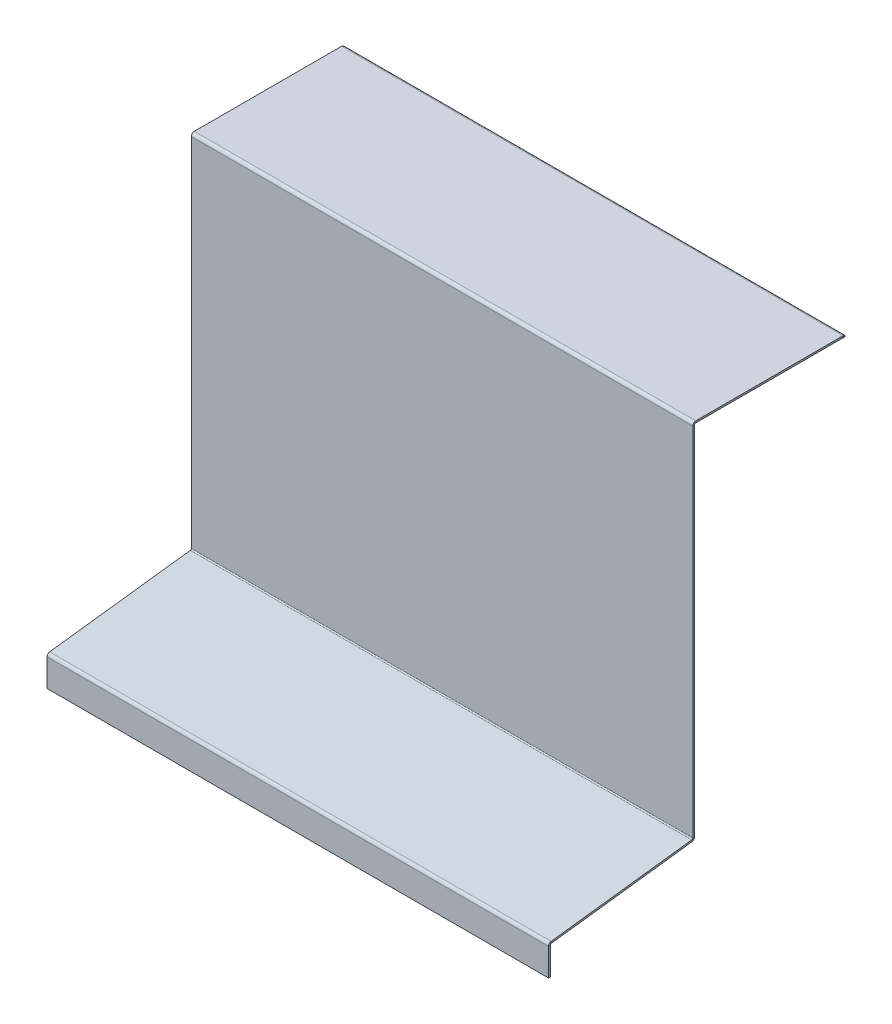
ISO-10303-21;
HEADER;
FILE_DESCRIPTION(('STEP AP214'),'2;1');
FILE_NAME('part.step','',(''),(''),'','','');
FILE_SCHEMA(('AUTOMOTIVE_DESIGN { 1 0 10303 214 1 1 1 1 }'));
ENDSEC;
DATA;
#1=APPLICATION_CONTEXT('core data for automotive mechanical design processes');
#2=APPLICATION_PROTOCOL_DEFINITION('international standard','automotive_design',2000,#1);
#3=PRODUCT_CONTEXT('',#1,'mechanical');
#4=PRODUCT('Part','Part','',(#3));
#5=PRODUCT_RELATED_PRODUCT_CATEGORY('part','',(#4));
#6=PRODUCT_DEFINITION_FORMATION('','',#4);
#7=PRODUCT_DEFINITION_CONTEXT('part definition',#1,'design');
#8=PRODUCT_DEFINITION('design','',#6,#7);
#9=PRODUCT_DEFINITION_SHAPE('','',#8);
#10=(LENGTH_UNIT() NAMED_UNIT(*) SI_UNIT(.MILLI.,.METRE.));
#11=(NAMED_UNIT(*) PLANE_ANGLE_UNIT() SI_UNIT($,.RADIAN.));
#12=(NAMED_UNIT(*) SI_UNIT($,.STERADIAN.) SOLID_ANGLE_UNIT());
#13=UNCERTAINTY_MEASURE_WITH_UNIT(LENGTH_MEASURE(1.E-05),#10,'distance_accuracy_value','');
#14=(GEOMETRIC_REPRESENTATION_CONTEXT(3) GLOBAL_UNCERTAINTY_ASSIGNED_CONTEXT((#13)) GLOBAL_UNIT_ASSIGNED_CONTEXT((#10,
#11,#12)) REPRESENTATION_CONTEXT('',''));
#15=CARTESIAN_POINT('',(0.,0.,0.));
#16=DIRECTION('',(0.,0.,1.));
#17=DIRECTION('',(1.,0.,0.));
#18=AXIS2_PLACEMENT_3D('',#15,#16,#17);
#19=CARTESIAN_POINT('',(195.,285.,-116.));
#20=DIRECTION('',(-1.,0.,0.));
#21=DIRECTION('',(0.,0.,1.));
#22=AXIS2_PLACEMENT_3D('',#19,#20,#21);
#23=PLANE('',#22);
#24=DIRECTION('',(0.,1.,0.));
#25=VECTOR('',#24,1.);
#26=CARTESIAN_POINT('',(195.,285.,-117.));
#27=LINE('',#26,#25);
#28=CARTESIAN_POINT('',(195.,285.,-117.));
#29=VERTEX_POINT('',#28);
#30=CARTESIAN_POINT('',(195.,286.5,-117.));
#31=VERTEX_POINT('',#30);
#32=EDGE_CURVE('E320',#29,#31,#27,.T.);
#33=ORIENTED_EDGE('',*,*,#32,.F.);
#34=DIRECTION('',(0.,0.,1.));
#35=VECTOR('',#34,1.);
#36=CARTESIAN_POINT('',(195.,285.,-126.));
#37=LINE('',#36,#35);
#38=CARTESIAN_POINT('',(195.,285.,-125.));
#39=VERTEX_POINT('',#38);
#40=EDGE_CURVE('E1323',#39,#29,#37,.T.);
#41=ORIENTED_EDGE('',*,*,#40,.F.);
#42=DIRECTION('',(0.,1.,0.));
#43=VECTOR('',#42,1.);
#44=CARTESIAN_POINT('',(195.,286.5,-125.));
#45=LINE('',#44,#43);
#46=CARTESIAN_POINT('',(195.,286.5,-125.));
#47=VERTEX_POINT('',#46);
#48=EDGE_CURVE('E1339',#47,#39,#45,.F.);
#49=ORIENTED_EDGE('',*,*,#48,.F.);
#50=DIRECTION('',(0.,0.,-1.));
#51=VECTOR('',#50,1.);
#52=CARTESIAN_POINT('',(195.,286.5,-116.));
#53=LINE('',#52,#51);
#54=EDGE_CURVE('E1330',#47,#31,#53,.F.);
#55=ORIENTED_EDGE('',*,*,#54,.T.);
#56=EDGE_LOOP('',(#33,#41,#49,#55));
#57=FACE_BOUND('',#56,.T.);
#58=ADVANCED_FACE('F59',(#57),#23,.F.);
#59=CARTESIAN_POINT('',(-195.,285.,-126.));
#60=DIRECTION('',(1.,0.,0.));
#61=DIRECTION('',(0.,0.,-1.));
#62=AXIS2_PLACEMENT_3D('',#59,#60,#61);
#63=PLANE('',#62);
#64=DIRECTION('',(0.,1.,0.));
#65=VECTOR('',#64,1.);
#66=CARTESIAN_POINT('',(-195.,285.,-117.));
#67=LINE('',#66,#65);
#68=CARTESIAN_POINT('',(-195.,285.,-117.));
#69=VERTEX_POINT('',#68);
#70=CARTESIAN_POINT('',(-195.,286.5,-117.));
#71=VERTEX_POINT('',#70);
#72=EDGE_CURVE('E323',#69,#71,#67,.T.);
#73=ORIENTED_EDGE('',*,*,#72,.T.);
#74=DIRECTION('',(0.,0.,1.));
#75=VECTOR('',#74,1.);
#76=CARTESIAN_POINT('',(-195.,286.5,-126.));
#77=LINE('',#76,#75);
#78=CARTESIAN_POINT('',(-195.,286.5,-125.));
#79=VERTEX_POINT('',#78);
#80=EDGE_CURVE('E1328',#71,#79,#77,.F.);
#81=ORIENTED_EDGE('',*,*,#80,.T.);
#82=DIRECTION('',(0.,1.,0.));
#83=VECTOR('',#82,1.);
#84=CARTESIAN_POINT('',(-195.,285.,-125.));
#85=LINE('',#84,#83);
#86=CARTESIAN_POINT('',(-195.,285.,-125.));
#87=VERTEX_POINT('',#86);
#88=EDGE_CURVE('E322',#79,#87,#85,.F.);
#89=ORIENTED_EDGE('',*,*,#88,.T.);
#90=DIRECTION('',(0.,0.,-1.));
#91=VECTOR('',#90,1.);
#92=CARTESIAN_POINT('',(-195.,285.,-126.));
#93=LINE('',#92,#91);
#94=EDGE_CURVE('E359',#69,#87,#93,.T.);
#95=ORIENTED_EDGE('',*,*,#94,.F.);
#96=EDGE_LOOP('',(#73,#81,#89,#95));
#97=FACE_BOUND('',#96,.T.);
#98=ADVANCED_FACE('F376',(#97),#63,.F.);
#99=CARTESIAN_POINT('',(195.,285.,-126.));
#100=DIRECTION('',(0.,1.,0.));
#101=DIRECTION('',(0.,0.,1.));
#102=AXIS2_PLACEMENT_3D('',#99,#100,#101);
#103=PLANE('',#102);
#104=DIRECTION('',(-1.,0.,0.));
#105=VECTOR('',#104,1.);
#106=CARTESIAN_POINT('',(-195.,285.,-117.));
#107=LINE('',#106,#105);
#108=EDGE_CURVE('E315',#69,#29,#107,.F.);
#109=ORIENTED_EDGE('',*,*,#108,.F.);
#110=ORIENTED_EDGE('',*,*,#94,.T.);
#111=DIRECTION('',(1.,0.,0.));
#112=VECTOR('',#111,1.);
#113=CARTESIAN_POINT('',(-195.,285.,-125.));
#114=LINE('',#113,#112);
#115=EDGE_CURVE('E1335',#39,#87,#114,.F.);
#116=ORIENTED_EDGE('',*,*,#115,.F.);
#117=ORIENTED_EDGE('',*,*,#40,.T.);
#118=EDGE_LOOP('',(#109,#110,#116,#117));
#119=FACE_BOUND('',#118,.T.);
#120=ADVANCED_FACE('F366',(#119),#103,.F.);
#121=CARTESIAN_POINT('',(195.,286.5,-126.));
#122=DIRECTION('',(0.,1.,0.));
#123=DIRECTION('',(0.,0.,1.));
#124=AXIS2_PLACEMENT_3D('',#121,#122,#123);
#125=PLANE('',#124);
#126=ORIENTED_EDGE('',*,*,#80,.F.);
#127=DIRECTION('',(-1.,0.,0.));
#128=VECTOR('',#127,1.);
#129=CARTESIAN_POINT('',(-195.,286.5,-117.));
#130=LINE('',#129,#128);
#131=EDGE_CURVE('E268',#71,#31,#130,.F.);
#132=ORIENTED_EDGE('',*,*,#131,.T.);
#133=ORIENTED_EDGE('',*,*,#54,.F.);
#134=DIRECTION('',(1.,0.,0.));
#135=VECTOR('',#134,1.);
#136=CARTESIAN_POINT('',(-195.,286.5,-125.));
#137=LINE('',#136,#135);
#138=EDGE_CURVE('E1342',#79,#47,#137,.T.);
#139=ORIENTED_EDGE('',*,*,#138,.F.);
#140=EDGE_LOOP('',(#126,#132,#133,#139));
#141=FACE_BOUND('',#140,.T.);
#142=ADVANCED_FACE('F375',(#141),#125,.T.);
#143=CARTESIAN_POINT('',(195.,285.,-126.));
#144=DIRECTION('',(-1.,0.,0.));
#145=DIRECTION('',(0.,-1.,0.));
#146=AXIS2_PLACEMENT_3D('',#143,#144,#145);
#147=PLANE('',#146);
#148=DIRECTION('',(0.,1.,0.));
#149=VECTOR('',#148,1.);
#150=CARTESIAN_POINT('',(195.,285.,-126.));
#151=LINE('',#150,#149);
#152=CARTESIAN_POINT('',(195.,285.,-126.));
#153=VERTEX_POINT('',#152);
#154=CARTESIAN_POINT('',(195.,285.208712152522,-126.));
#155=VERTEX_POINT('',#154);
#156=EDGE_CURVE('E1290',#153,#155,#151,.T.);
#157=ORIENTED_EDGE('',*,*,#156,.T.);
#158=CARTESIAN_POINT('',(195.,287.5,-125.));
#159=DIRECTION('',(1.,0.,0.));
#160=DIRECTION('',(0.,0.,-1.));
#161=AXIS2_PLACEMENT_3D('',#158,#159,#160);
#162=CIRCLE('',#161,2.5);
#163=CARTESIAN_POINT('',(195.,287.5,-127.5));
#164=VERTEX_POINT('',#163);
#165=EDGE_CURVE('E13',#155,#164,#162,.T.);
#166=ORIENTED_EDGE('',*,*,#165,.T.);
#167=DIRECTION('',(0.,1.,0.));
#168=VECTOR('',#167,1.);
#169=CARTESIAN_POINT('',(195.,298.5,-127.5));
#170=LINE('',#169,#168);
#171=CARTESIAN_POINT('',(195.,285.,-127.5));
#172=VERTEX_POINT('',#171);
#173=EDGE_CURVE('E1254',#172,#164,#170,.T.);
#174=ORIENTED_EDGE('',*,*,#173,.F.);
#175=DIRECTION('',(0.,0.,1.));
#176=VECTOR('',#175,1.);
#177=CARTESIAN_POINT('',(195.,285.,-127.5));
#178=LINE('',#177,#176);
#179=EDGE_CURVE('E482',#172,#153,#178,.T.);
#180=ORIENTED_EDGE('',*,*,#179,.T.);
#181=EDGE_LOOP('',(#157,#166,#174,#180));
#182=FACE_BOUND('',#181,.T.);
#183=ADVANCED_FACE('F380',(#182),#147,.T.);
#184=CARTESIAN_POINT('',(-195.,287.5,-126.));
#185=DIRECTION('',(1.,0.,0.));
#186=DIRECTION('',(0.,0.,-1.));
#187=AXIS2_PLACEMENT_3D('',#184,#185,#186);
#188=PLANE('',#187);
#189=DIRECTION('',(0.,-1.,0.));
#190=VECTOR('',#189,1.);
#191=CARTESIAN_POINT('',(-195.,298.5,-127.5));
#192=LINE('',#191,#190);
#193=CARTESIAN_POINT('',(-195.,287.5,-127.5));
#194=VERTEX_POINT('',#193);
#195=CARTESIAN_POINT('',(-195.,285.,-127.5));
#196=VERTEX_POINT('',#195);
#197=EDGE_CURVE('E1260',#194,#196,#192,.T.);
#198=ORIENTED_EDGE('',*,*,#197,.F.);
#199=CARTESIAN_POINT('',(-195.,287.5,-125.));
#200=DIRECTION('',(1.,0.,0.));
#201=DIRECTION('',(0.,0.,-1.));
#202=AXIS2_PLACEMENT_3D('',#199,#200,#201);
#203=CIRCLE('',#202,2.5);
#204=CARTESIAN_POINT('',(-195.,285.208712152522,-126.));
#205=VERTEX_POINT('',#204);
#206=EDGE_CURVE('E1304',#194,#205,#203,.F.);
#207=ORIENTED_EDGE('',*,*,#206,.T.);
#208=DIRECTION('',(0.,-1.,0.));
#209=VECTOR('',#208,1.);
#210=CARTESIAN_POINT('',(-195.,287.5,-126.));
#211=LINE('',#210,#209);
#212=CARTESIAN_POINT('',(-195.,285.,-126.));
#213=VERTEX_POINT('',#212);
#214=EDGE_CURVE('E1300',#205,#213,#211,.T.);
#215=ORIENTED_EDGE('',*,*,#214,.T.);
#216=DIRECTION('',(0.,0.,1.));
#217=VECTOR('',#216,1.);
#218=CARTESIAN_POINT('',(-195.,285.,-127.5));
#219=LINE('',#218,#217);
#220=EDGE_CURVE('E1275',#196,#213,#219,.T.);
#221=ORIENTED_EDGE('',*,*,#220,.F.);
#222=EDGE_LOOP('',(#198,#207,#215,#221));
#223=FACE_BOUND('',#222,.T.);
#224=ADVANCED_FACE('F405',(#223),#188,.T.);
#225=CARTESIAN_POINT('',(208.5,298.5,-127.5));
#226=DIRECTION('',(0.,0.,-1.));
#227=DIRECTION('',(0.,1.,0.));
#228=AXIS2_PLACEMENT_3D('',#225,#226,#227);
#229=PLANE('',#228);
#230=DIRECTION('',(0.707106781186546,0.707106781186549,0.));
#231=VECTOR('',#230,1.);
#232=CARTESIAN_POINT('',(208.5,298.5,-127.5));
#233=LINE('',#232,#231);
#234=CARTESIAN_POINT('',(207.5,297.5,-127.5));
#235=VERTEX_POINT('',#234);
#236=EDGE_CURVE('E1271',#172,#235,#233,.T.);
#237=ORIENTED_EDGE('',*,*,#236,.F.);
#238=ORIENTED_EDGE('',*,*,#173,.T.);
#239=DIRECTION('',(1.,0.,0.));
#240=VECTOR('',#239,1.);
#241=CARTESIAN_POINT('',(195.,287.5,-127.5));
#242=LINE('',#241,#240);
#243=EDGE_CURVE('E1309',#164,#194,#242,.F.);
#244=ORIENTED_EDGE('',*,*,#243,.T.);
#245=ORIENTED_EDGE('',*,*,#197,.T.);
#246=DIRECTION('',(0.707106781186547,-0.707106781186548,0.));
#247=VECTOR('',#246,1.);
#248=CARTESIAN_POINT('',(-195.,285.,-127.5));
#249=LINE('',#248,#247);
#250=CARTESIAN_POINT('',(-207.5,297.5,-127.5));
#251=VERTEX_POINT('',#250);
#252=EDGE_CURVE('E1269',#251,#196,#249,.T.);
#253=ORIENTED_EDGE('',*,*,#252,.F.);
#254=DIRECTION('',(1.,0.,0.));
#255=VECTOR('',#254,1.);
#256=CARTESIAN_POINT('',(208.5,297.5,-127.5));
#257=LINE('',#256,#255);
#258=EDGE_CURVE('E1264',#251,#235,#257,.T.);
#259=ORIENTED_EDGE('',*,*,#258,.T.);
#260=EDGE_LOOP('',(#237,#238,#244,#245,#253,#259));
#261=FACE_BOUND('',#260,.T.);
#262=ADVANCED_FACE('F408',(#261),#229,.T.);
#263=CARTESIAN_POINT('',(208.5,298.5,-126.));
#264=DIRECTION('',(0.,0.,-1.));
#265=DIRECTION('',(0.,1.,0.));
#266=AXIS2_PLACEMENT_3D('',#263,#264,#265);
#267=PLANE('',#266);
#268=ORIENTED_EDGE('',*,*,#156,.F.);
#269=DIRECTION('',(0.707106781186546,0.707106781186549,0.));
#270=VECTOR('',#269,1.);
#271=CARTESIAN_POINT('',(208.5,298.5,-126.));
#272=LINE('',#271,#270);
#273=CARTESIAN_POINT('',(207.5,297.5,-126.));
#274=VERTEX_POINT('',#273);
#275=EDGE_CURVE('E1272',#153,#274,#272,.T.);
#276=ORIENTED_EDGE('',*,*,#275,.T.);
#277=DIRECTION('',(1.,0.,0.));
#278=VECTOR('',#277,1.);
#279=CARTESIAN_POINT('',(-207.5,297.5,-126.));
#280=LINE('',#279,#278);
#281=CARTESIAN_POINT('',(-207.5,297.5,-126.));
#282=VERTEX_POINT('',#281);
#283=EDGE_CURVE('E1253',#282,#274,#280,.T.);
#284=ORIENTED_EDGE('',*,*,#283,.F.);
#285=DIRECTION('',(0.707106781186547,-0.707106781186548,0.));
#286=VECTOR('',#285,1.);
#287=CARTESIAN_POINT('',(-195.,285.,-126.));
#288=LINE('',#287,#286);
#289=EDGE_CURVE('E1268',#282,#213,#288,.T.);
#290=ORIENTED_EDGE('',*,*,#289,.T.);
#291=ORIENTED_EDGE('',*,*,#214,.F.);
#292=CARTESIAN_POINT('',(-195.,287.5,-126.));
#293=VERTEX_POINT('',#292);
#294=EDGE_CURVE('E1294',#293,#205,#211,.T.);
#295=ORIENTED_EDGE('',*,*,#294,.F.);
#296=DIRECTION('',(1.,0.,0.));
#297=VECTOR('',#296,1.);
#298=CARTESIAN_POINT('',(195.,287.5,-126.));
#299=LINE('',#298,#297);
#300=CARTESIAN_POINT('',(195.,287.5,-126.));
#301=VERTEX_POINT('',#300);
#302=EDGE_CURVE('E1316',#301,#293,#299,.F.);
#303=ORIENTED_EDGE('',*,*,#302,.F.);
#304=EDGE_CURVE('E84',#155,#301,#151,.T.);
#305=ORIENTED_EDGE('',*,*,#304,.F.);
#306=EDGE_LOOP('',(#268,#276,#284,#290,#291,#295,#303,#305));
#307=FACE_BOUND('',#306,.T.);
#308=ADVANCED_FACE('F415',(#307),#267,.F.);
#309=CARTESIAN_POINT('',(208.5,297.5,-1.5));
#310=DIRECTION('',(1.,0.,0.));
#311=DIRECTION('',(0.,0.,-1.));
#312=AXIS2_PLACEMENT_3D('',#309,#310,#311);
#313=PLANE('',#312);
#314=DIRECTION('',(0.,0.,1.));
#315=VECTOR('',#314,1.);
#316=CARTESIAN_POINT('',(208.5,298.5,0.));
#317=LINE('',#316,#315);
#318=CARTESIAN_POINT('',(208.5,298.5,-125.));
#319=VERTEX_POINT('',#318);
#320=CARTESIAN_POINT('',(208.5,298.5,-2.5));
#321=VERTEX_POINT('',#320);
#322=EDGE_CURVE('E507',#319,#321,#317,.T.);
#323=ORIENTED_EDGE('',*,*,#322,.F.);
#324=DIRECTION('',(0.,1.,0.));
#325=VECTOR('',#324,1.);
#326=CARTESIAN_POINT('',(208.5,298.5,-125.));
#327=LINE('',#326,#325);
#328=CARTESIAN_POINT('',(208.5,300.,-125.));
#329=VERTEX_POINT('',#328);
#330=EDGE_CURVE('E1241',#319,#329,#327,.T.);
#331=ORIENTED_EDGE('',*,*,#330,.T.);
#332=DIRECTION('',(0.,0.,1.));
#333=VECTOR('',#332,1.);
#334=CARTESIAN_POINT('',(208.5,300.,0.));
#335=LINE('',#334,#333);
#336=CARTESIAN_POINT('',(208.5,300.,-2.5));
#337=VERTEX_POINT('',#336);
#338=EDGE_CURVE('E509',#329,#337,#335,.T.);
#339=ORIENTED_EDGE('',*,*,#338,.T.);
#340=DIRECTION('',(0.,-1.,0.));
#341=VECTOR('',#340,1.);
#342=CARTESIAN_POINT('',(208.5,300.,-2.5));
#343=LINE('',#342,#341);
#344=EDGE_CURVE('E63',#337,#321,#343,.T.);
#345=ORIENTED_EDGE('',*,*,#344,.T.);
#346=EDGE_LOOP('',(#323,#331,#339,#345));
#347=FACE_BOUND('',#346,.T.);
#348=ADVANCED_FACE('F419',(#347),#313,.T.);
#349=CARTESIAN_POINT('',(208.5,298.5,0.));
#350=DIRECTION('',(0.,-1.,0.));
#351=DIRECTION('',(0.,0.,-1.));
#352=AXIS2_PLACEMENT_3D('',#349,#350,#351);
#353=PLANE('',#352);
#354=DIRECTION('',(0.,0.,1.));
#355=VECTOR('',#354,1.);
#356=CARTESIAN_POINT('',(-208.5,298.5,0.));
#357=LINE('',#356,#355);
#358=CARTESIAN_POINT('',(-208.5,298.5,-125.));
#359=VERTEX_POINT('',#358);
#360=CARTESIAN_POINT('',(-208.5,298.5,-2.5));
#361=VERTEX_POINT('',#360);
#362=EDGE_CURVE('E552',#359,#361,#357,.T.);
#363=ORIENTED_EDGE('',*,*,#362,.F.);
#364=DIRECTION('',(1.,0.,0.));
#365=VECTOR('',#364,1.);
#366=CARTESIAN_POINT('',(208.5,298.5,-125.));
#367=LINE('',#366,#365);
#368=EDGE_CURVE('E481',#319,#359,#367,.F.);
#369=ORIENTED_EDGE('',*,*,#368,.F.);
#370=ORIENTED_EDGE('',*,*,#322,.T.);
#371=DIRECTION('',(-1.,0.,0.));
#372=VECTOR('',#371,1.);
#373=CARTESIAN_POINT('',(208.5,298.5,-2.5));
#374=LINE('',#373,#372);
#375=EDGE_CURVE('E587',#321,#361,#374,.T.);
#376=ORIENTED_EDGE('',*,*,#375,.T.);
#377=EDGE_LOOP('',(#363,#369,#370,#376));
#378=FACE_BOUND('',#377,.T.);
#379=ADVANCED_FACE('F741',(#378),#353,.T.);
#380=CARTESIAN_POINT('',(208.5,300.,0.));
#381=DIRECTION('',(0.,-1.,0.));
#382=DIRECTION('',(0.,0.,-1.));
#383=AXIS2_PLACEMENT_3D('',#380,#381,#382);
#384=PLANE('',#383);
#385=DIRECTION('',(1.,0.,0.));
#386=VECTOR('',#385,1.);
#387=CARTESIAN_POINT('',(208.5,300.,-125.));
#388=LINE('',#387,#386);
#389=CARTESIAN_POINT('',(-208.5,300.,-125.));
#390=VERTEX_POINT('',#389);
#391=EDGE_CURVE('E452',#329,#390,#388,.F.);
#392=ORIENTED_EDGE('',*,*,#391,.T.);
#393=DIRECTION('',(0.,0.,1.));
#394=VECTOR('',#393,1.);
#395=CARTESIAN_POINT('',(-208.5,300.,0.));
#396=LINE('',#395,#394);
#397=CARTESIAN_POINT('',(-208.5,300.,-2.5));
#398=VERTEX_POINT('',#397);
#399=EDGE_CURVE('E554',#390,#398,#396,.T.);
#400=ORIENTED_EDGE('',*,*,#399,.T.);
#401=DIRECTION('',(-1.,0.,0.));
#402=VECTOR('',#401,1.);
#403=CARTESIAN_POINT('',(208.5,300.,-2.5));
#404=LINE('',#403,#402);
#405=EDGE_CURVE('E584',#337,#398,#404,.T.);
#406=ORIENTED_EDGE('',*,*,#405,.F.);
#407=ORIENTED_EDGE('',*,*,#338,.F.);
#408=EDGE_LOOP('',(#392,#400,#406,#407));
#409=FACE_BOUND('',#408,.T.);
#410=ADVANCED_FACE('F745',(#409),#384,.F.);
#411=CARTESIAN_POINT('',(-208.5,-17.2069555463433,117.5));
#412=DIRECTION('',(1.,0.,0.));
#413=DIRECTION('',(0.,0.,-1.));
#414=AXIS2_PLACEMENT_3D('',#411,#412,#413);
#415=PLANE('',#414);
#416=DIRECTION('',(0.,1.,0.));
#417=VECTOR('',#416,1.);
#418=CARTESIAN_POINT('',(-208.5,298.5,-125.));
#419=LINE('',#418,#417);
#420=EDGE_CURVE('E531',#359,#390,#419,.T.);
#421=ORIENTED_EDGE('',*,*,#420,.F.);
#422=ORIENTED_EDGE('',*,*,#362,.T.);
#423=DIRECTION('',(0.,1.,0.));
#424=VECTOR('',#423,1.);
#425=CARTESIAN_POINT('',(-208.5,298.5,-2.5));
#426=LINE('',#425,#424);
#427=EDGE_CURVE('E625',#361,#398,#426,.T.);
#428=ORIENTED_EDGE('',*,*,#427,.T.);
#429=ORIENTED_EDGE('',*,*,#399,.F.);
#430=EDGE_LOOP('',(#421,#422,#428,#429));
#431=FACE_BOUND('',#430,.T.);
#432=ADVANCED_FACE('F750',(#431),#415,.F.);
#433=CARTESIAN_POINT('',(208.5,300.,-2.5));
#434=DIRECTION('',(1.,0.,0.));
#435=DIRECTION('',(0.,0.,-1.));
#436=AXIS2_PLACEMENT_3D('',#433,#434,#435);
#437=PLANE('',#436);
#438=ORIENTED_EDGE('',*,*,#344,.F.);
#439=CARTESIAN_POINT('',(208.5,297.5,-2.5));
#440=DIRECTION('',(-1.,0.,0.));
#441=DIRECTION('',(0.,0.,1.));
#442=AXIS2_PLACEMENT_3D('',#439,#440,#441);
#443=CIRCLE('',#442,2.5);
#444=CARTESIAN_POINT('',(208.5,297.5,0.));
#445=VERTEX_POINT('',#444);
#446=EDGE_CURVE('E511',#337,#445,#443,.F.);
#447=ORIENTED_EDGE('',*,*,#446,.T.);
#448=DIRECTION('',(0.,0.,1.));
#449=VECTOR('',#448,1.);
#450=CARTESIAN_POINT('',(208.5,297.5,-1.5));
#451=LINE('',#450,#449);
#452=CARTESIAN_POINT('',(208.5,297.5,-1.5));
#453=VERTEX_POINT('',#452);
#454=EDGE_CURVE('E629',#453,#445,#451,.T.);
#455=ORIENTED_EDGE('',*,*,#454,.F.);
#456=CARTESIAN_POINT('',(208.5,297.5,-2.5));
#457=DIRECTION('',(1.,0.,0.));
#458=DIRECTION('',(0.,0.,-1.));
#459=AXIS2_PLACEMENT_3D('',#456,#457,#458);
#460=CIRCLE('',#459,1.);
#461=EDGE_CURVE('E504',#321,#453,#460,.T.);
#462=ORIENTED_EDGE('',*,*,#461,.F.);
#463=EDGE_LOOP('',(#438,#447,#455,#462));
#464=FACE_BOUND('',#463,.T.);
#465=ADVANCED_FACE('F61',(#464),#437,.T.);
#466=CARTESIAN_POINT('',(-208.5,297.5,0.));
#467=DIRECTION('',(-1.,0.,0.));
#468=DIRECTION('',(0.,0.,1.));
#469=AXIS2_PLACEMENT_3D('',#466,#467,#468);
#470=PLANE('',#469);
#471=DIRECTION('',(0.,0.,-1.));
#472=VECTOR('',#471,1.);
#473=CARTESIAN_POINT('',(-208.5,297.5,0.));
#474=LINE('',#473,#472);
#475=CARTESIAN_POINT('',(-208.5,297.5,0.));
#476=VERTEX_POINT('',#475);
#477=CARTESIAN_POINT('',(-208.5,297.5,-1.5));
#478=VERTEX_POINT('',#477);
#479=EDGE_CURVE('E628',#476,#478,#474,.T.);
#480=ORIENTED_EDGE('',*,*,#479,.F.);
#481=CARTESIAN_POINT('',(-208.5,297.5,-2.5));
#482=DIRECTION('',(-1.,0.,0.));
#483=DIRECTION('',(0.,0.,1.));
#484=AXIS2_PLACEMENT_3D('',#481,#482,#483);
#485=CIRCLE('',#484,2.5);
#486=EDGE_CURVE('E556',#398,#476,#485,.F.);
#487=ORIENTED_EDGE('',*,*,#486,.F.);
#488=ORIENTED_EDGE('',*,*,#427,.F.);
#489=CARTESIAN_POINT('',(-208.5,297.5,-2.5));
#490=DIRECTION('',(1.,0.,0.));
#491=DIRECTION('',(0.,0.,-1.));
#492=AXIS2_PLACEMENT_3D('',#489,#490,#491);
#493=CIRCLE('',#492,1.);
#494=EDGE_CURVE('E549',#361,#478,#493,.T.);
#495=ORIENTED_EDGE('',*,*,#494,.T.);
#496=EDGE_LOOP('',(#480,#487,#488,#495));
#497=FACE_BOUND('',#496,.T.);
#498=ADVANCED_FACE('F736',(#497),#470,.T.);
#499=CARTESIAN_POINT('',(-208.5,298.5,-2.5));
#500=DIRECTION('',(-1.,0.,0.));
#501=DIRECTION('',(0.,0.,1.));
#502=AXIS2_PLACEMENT_3D('',#499,#500,#501);
#503=PLANE('',#502);
#504=DIRECTION('',(0.,-1.,0.));
#505=VECTOR('',#504,1.);
#506=CARTESIAN_POINT('',(-208.5,0.,0.));
#507=LINE('',#506,#505);
#508=CARTESIAN_POINT('',(-208.5,0.882782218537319,0.));
#509=VERTEX_POINT('',#508);
#510=EDGE_CURVE('E559',#476,#509,#507,.T.);
#511=ORIENTED_EDGE('',*,*,#510,.F.);
#512=ORIENTED_EDGE('',*,*,#479,.T.);
#513=DIRECTION('',(0.,1.,0.));
#514=VECTOR('',#513,1.);
#515=CARTESIAN_POINT('',(-208.5,0.,-1.5));
#516=LINE('',#515,#514);
#517=CARTESIAN_POINT('',(-208.5,0.882782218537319,-1.5));
#518=VERTEX_POINT('',#517);
#519=EDGE_CURVE('E546',#478,#518,#516,.F.);
#520=ORIENTED_EDGE('',*,*,#519,.T.);
#521=DIRECTION('',(0.,0.,1.));
#522=VECTOR('',#521,1.);
#523=CARTESIAN_POINT('',(-208.5,0.882782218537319,-1.5));
#524=LINE('',#523,#522);
#525=EDGE_CURVE('E617',#518,#509,#524,.T.);
#526=ORIENTED_EDGE('',*,*,#525,.T.);
#527=EDGE_LOOP('',(#511,#512,#520,#526));
#528=FACE_BOUND('',#527,.T.);
#529=ADVANCED_FACE('F733',(#528),#503,.T.);
#530=CARTESIAN_POINT('',(208.5,0.882782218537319,0.));
#531=DIRECTION('',(1.,0.,0.));
#532=DIRECTION('',(0.,0.,-1.));
#533=AXIS2_PLACEMENT_3D('',#530,#531,#532);
#534=PLANE('',#533);
#535=DIRECTION('',(0.,0.,-1.));
#536=VECTOR('',#535,1.);
#537=CARTESIAN_POINT('',(208.5,0.882782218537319,0.));
#538=LINE('',#537,#536);
#539=CARTESIAN_POINT('',(208.5,0.882782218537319,0.));
#540=VERTEX_POINT('',#539);
#541=CARTESIAN_POINT('',(208.5,0.882782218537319,-1.5));
#542=VERTEX_POINT('',#541);
#543=EDGE_CURVE('E623',#540,#542,#538,.T.);
#544=ORIENTED_EDGE('',*,*,#543,.F.);
#545=CARTESIAN_POINT('',(208.5,0.882782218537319,1.));
#546=DIRECTION('',(1.,0.,0.));
#547=DIRECTION('',(0.,0.,-1.));
#548=AXIS2_PLACEMENT_3D('',#545,#546,#547);
#549=CIRCLE('',#548,1.);
#550=CARTESIAN_POINT('',(208.5,-0.109495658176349,0.875965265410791));
#551=VERTEX_POINT('',#550);
#552=EDGE_CURVE('E517',#540,#551,#549,.F.);
#553=ORIENTED_EDGE('',*,*,#552,.T.);
#554=DIRECTION('',(0.,0.992277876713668,0.124034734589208));
#555=VECTOR('',#554,1.);
#556=CARTESIAN_POINT('',(208.5,-1.59791247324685,0.689913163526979));
#557=LINE('',#556,#555);
#558=CARTESIAN_POINT('',(208.5,-1.59791247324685,0.689913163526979));
#559=VERTEX_POINT('',#558);
#560=EDGE_CURVE('E621',#559,#551,#557,.T.);
#561=ORIENTED_EDGE('',*,*,#560,.F.);
#562=CARTESIAN_POINT('',(208.5,0.882782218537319,1.));
#563=DIRECTION('',(1.,0.,0.));
#564=DIRECTION('',(0.,0.,-1.));
#565=AXIS2_PLACEMENT_3D('',#562,#563,#564);
#566=CIRCLE('',#565,2.5);
#567=EDGE_CURVE('E498',#542,#559,#566,.F.);
#568=ORIENTED_EDGE('',*,*,#567,.F.);
#569=EDGE_LOOP('',(#544,#553,#561,#568));
#570=FACE_BOUND('',#569,.T.);
#571=ADVANCED_FACE('F662',(#570),#534,.T.);
#572=CARTESIAN_POINT('',(208.5,-1.59791247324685,0.689913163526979));
#573=DIRECTION('',(1.,0.,0.));
#574=DIRECTION('',(0.,0.,-1.));
#575=AXIS2_PLACEMENT_3D('',#572,#573,#574);
#576=PLANE('',#575);
#577=DIRECTION('',(0.,-1.,0.));
#578=VECTOR('',#577,1.);
#579=CARTESIAN_POINT('',(208.5,0.,0.));
#580=LINE('',#579,#578);
#581=EDGE_CURVE('E514',#445,#540,#580,.T.);
#582=ORIENTED_EDGE('',*,*,#581,.T.);
#583=ORIENTED_EDGE('',*,*,#543,.T.);
#584=DIRECTION('',(0.,1.,0.));
#585=VECTOR('',#584,1.);
#586=CARTESIAN_POINT('',(208.5,0.,-1.5));
#587=LINE('',#586,#585);
#588=EDGE_CURVE('E501',#453,#542,#587,.F.);
#589=ORIENTED_EDGE('',*,*,#588,.F.);
#590=ORIENTED_EDGE('',*,*,#454,.T.);
#591=EDGE_LOOP('',(#582,#583,#589,#590));
#592=FACE_BOUND('',#591,.T.);
#593=ADVANCED_FACE('F653',(#592),#576,.T.);
#594=CARTESIAN_POINT('',(-208.5,-0.109495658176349,0.875965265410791));
#595=DIRECTION('',(-1.,0.,0.));
#596=DIRECTION('',(0.,0.,1.));
#597=AXIS2_PLACEMENT_3D('',#594,#595,#596);
#598=PLANE('',#597);
#599=DIRECTION('',(0.,-0.992277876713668,-0.124034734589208));
#600=VECTOR('',#599,1.);
#601=CARTESIAN_POINT('',(-208.5,-0.109495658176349,0.875965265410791));
#602=LINE('',#601,#600);
#603=CARTESIAN_POINT('',(-208.5,-0.109495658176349,0.875965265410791));
#604=VERTEX_POINT('',#603);
#605=CARTESIAN_POINT('',(-208.5,-1.59791247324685,0.689913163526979));
#606=VERTEX_POINT('',#605);
#607=EDGE_CURVE('E619',#604,#606,#602,.T.);
#608=ORIENTED_EDGE('',*,*,#607,.F.);
#609=CARTESIAN_POINT('',(-208.5,0.882782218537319,1.));
#610=DIRECTION('',(1.,0.,0.));
#611=DIRECTION('',(0.,0.,-1.));
#612=AXIS2_PLACEMENT_3D('',#609,#610,#611);
#613=CIRCLE('',#612,1.);
#614=EDGE_CURVE('E562',#509,#604,#613,.F.);
#615=ORIENTED_EDGE('',*,*,#614,.F.);
#616=ORIENTED_EDGE('',*,*,#525,.F.);
#617=CARTESIAN_POINT('',(-208.5,0.882782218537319,1.));
#618=DIRECTION('',(1.,0.,0.));
#619=DIRECTION('',(0.,0.,-1.));
#620=AXIS2_PLACEMENT_3D('',#617,#618,#619);
#621=CIRCLE('',#620,2.5);
#622=EDGE_CURVE('E543',#518,#606,#621,.F.);
#623=ORIENTED_EDGE('',*,*,#622,.T.);
#624=EDGE_LOOP('',(#608,#615,#616,#623));
#625=FACE_BOUND('',#624,.T.);
#626=ADVANCED_FACE('F724',(#625),#598,.T.);
#627=CARTESIAN_POINT('',(-208.5,0.882782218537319,-1.5));
#628=DIRECTION('',(-1.,0.,0.));
#629=DIRECTION('',(0.,0.,1.));
#630=AXIS2_PLACEMENT_3D('',#627,#628,#629);
#631=PLANE('',#630);
#632=DIRECTION('',(0.,-0.124034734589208,0.992277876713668));
#633=VECTOR('',#632,1.);
#634=CARTESIAN_POINT('',(-208.5,0.,0.));
#635=LINE('',#634,#633);
#636=CARTESIAN_POINT('',(-208.5,-14.7262608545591,117.810086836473));
#637=VERTEX_POINT('',#636);
#638=EDGE_CURVE('E565',#604,#637,#635,.T.);
#639=ORIENTED_EDGE('',*,*,#638,.F.);
#640=ORIENTED_EDGE('',*,*,#607,.T.);
#641=DIRECTION('',(0.,-0.124034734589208,0.992277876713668));
#642=VECTOR('',#641,1.);
#643=CARTESIAN_POINT('',(-208.5,-1.4884168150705,-0.186052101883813));
#644=LINE('',#643,#642);
#645=CARTESIAN_POINT('',(-208.5,-16.2146776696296,117.624034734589));
#646=VERTEX_POINT('',#645);
#647=EDGE_CURVE('E540',#606,#646,#644,.T.);
#648=ORIENTED_EDGE('',*,*,#647,.T.);
#649=DIRECTION('',(0.,0.992277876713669,0.124034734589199));
#650=VECTOR('',#649,1.);
#651=CARTESIAN_POINT('',(-208.5,-16.2146776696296,117.624034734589));
#652=LINE('',#651,#650);
#653=EDGE_CURVE('E609',#646,#637,#652,.T.);
#654=ORIENTED_EDGE('',*,*,#653,.T.);
#655=EDGE_LOOP('',(#639,#640,#648,#654));
#656=FACE_BOUND('',#655,.T.);
#657=ADVANCED_FACE('F721',(#656),#631,.T.);
#658=CARTESIAN_POINT('',(208.5,-14.7262608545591,117.810086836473));
#659=DIRECTION('',(1.,0.,0.));
#660=DIRECTION('',(0.,0.,-1.));
#661=AXIS2_PLACEMENT_3D('',#658,#659,#660);
#662=PLANE('',#661);
#663=DIRECTION('',(0.,-0.992277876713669,-0.124034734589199));
#664=VECTOR('',#663,1.);
#665=CARTESIAN_POINT('',(208.5,-14.7262608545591,117.810086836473));
#666=LINE('',#665,#664);
#667=CARTESIAN_POINT('',(208.5,-14.7262608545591,117.810086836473));
#668=VERTEX_POINT('',#667);
#669=CARTESIAN_POINT('',(208.5,-16.2146776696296,117.624034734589));
#670=VERTEX_POINT('',#669);
#671=EDGE_CURVE('E615',#668,#670,#666,.T.);
#672=ORIENTED_EDGE('',*,*,#671,.F.);
#673=CARTESIAN_POINT('',(208.5,-17.2069555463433,117.5));
#674=DIRECTION('',(-1.,0.,0.));
#675=DIRECTION('',(0.,0.,1.));
#676=AXIS2_PLACEMENT_3D('',#673,#674,#675);
#677=CIRCLE('',#676,2.5);
#678=CARTESIAN_POINT('',(208.5,-17.2069555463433,120.));
#679=VERTEX_POINT('',#678);
#680=EDGE_CURVE('E523',#668,#679,#677,.F.);
#681=ORIENTED_EDGE('',*,*,#680,.T.);
#682=DIRECTION('',(0.,0.,1.));
#683=VECTOR('',#682,1.);
#684=CARTESIAN_POINT('',(208.5,-17.2069555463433,118.5));
#685=LINE('',#684,#683);
#686=CARTESIAN_POINT('',(208.5,-17.2069555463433,118.5));
#687=VERTEX_POINT('',#686);
#688=EDGE_CURVE('E613',#687,#679,#685,.T.);
#689=ORIENTED_EDGE('',*,*,#688,.F.);
#690=CARTESIAN_POINT('',(208.5,-17.2069555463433,117.5));
#691=DIRECTION('',(1.,0.,0.));
#692=DIRECTION('',(0.,0.,-1.));
#693=AXIS2_PLACEMENT_3D('',#690,#691,#692);
#694=CIRCLE('',#693,1.);
#695=EDGE_CURVE('E492',#670,#687,#694,.T.);
#696=ORIENTED_EDGE('',*,*,#695,.F.);
#697=EDGE_LOOP('',(#672,#681,#689,#696));
#698=FACE_BOUND('',#697,.T.);
#699=ADVANCED_FACE('F680',(#698),#662,.T.);
#700=CARTESIAN_POINT('',(208.5,-17.2069555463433,118.5));
#701=DIRECTION('',(1.,0.,0.));
#702=DIRECTION('',(0.,0.,-1.));
#703=AXIS2_PLACEMENT_3D('',#700,#701,#702);
#704=PLANE('',#703);
#705=DIRECTION('',(0.,-0.124034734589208,0.992277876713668));
#706=VECTOR('',#705,1.);
#707=CARTESIAN_POINT('',(208.5,0.,0.));
#708=LINE('',#707,#706);
#709=EDGE_CURVE('E520',#551,#668,#708,.T.);
#710=ORIENTED_EDGE('',*,*,#709,.T.);
#711=ORIENTED_EDGE('',*,*,#671,.T.);
#712=DIRECTION('',(0.,-0.124034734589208,0.992277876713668));
#713=VECTOR('',#712,1.);
#714=CARTESIAN_POINT('',(208.5,-1.4884168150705,-0.186052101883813));
#715=LINE('',#714,#713);
#716=EDGE_CURVE('E495',#559,#670,#715,.T.);
#717=ORIENTED_EDGE('',*,*,#716,.F.);
#718=ORIENTED_EDGE('',*,*,#560,.T.);
#719=EDGE_LOOP('',(#710,#711,#717,#718));
#720=FACE_BOUND('',#719,.T.);
#721=ADVANCED_FACE('F671',(#720),#704,.T.);
#722=CARTESIAN_POINT('',(-208.5,-17.2069555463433,120.));
#723=DIRECTION('',(-1.,0.,0.));
#724=DIRECTION('',(0.,0.,1.));
#725=AXIS2_PLACEMENT_3D('',#722,#723,#724);
#726=PLANE('',#725);
#727=DIRECTION('',(0.,0.,-1.));
#728=VECTOR('',#727,1.);
#729=CARTESIAN_POINT('',(-208.5,-17.2069555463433,120.));
#730=LINE('',#729,#728);
#731=CARTESIAN_POINT('',(-208.5,-17.2069555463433,120.));
#732=VERTEX_POINT('',#731);
#733=CARTESIAN_POINT('',(-208.5,-17.2069555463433,118.5));
#734=VERTEX_POINT('',#733);
#735=EDGE_CURVE('E611',#732,#734,#730,.T.);
#736=ORIENTED_EDGE('',*,*,#735,.F.);
#737=CARTESIAN_POINT('',(-208.5,-17.2069555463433,117.5));
#738=DIRECTION('',(-1.,0.,0.));
#739=DIRECTION('',(0.,0.,1.));
#740=AXIS2_PLACEMENT_3D('',#737,#738,#739);
#741=CIRCLE('',#740,2.5);
#742=EDGE_CURVE('E486',#637,#732,#741,.F.);
#743=ORIENTED_EDGE('',*,*,#742,.F.);
#744=ORIENTED_EDGE('',*,*,#653,.F.);
#745=CARTESIAN_POINT('',(-208.5,-17.2069555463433,117.5));
#746=DIRECTION('',(1.,0.,0.));
#747=DIRECTION('',(0.,0.,-1.));
#748=AXIS2_PLACEMENT_3D('',#745,#746,#747);
#749=CIRCLE('',#748,1.);
#750=EDGE_CURVE('E537',#646,#734,#749,.T.);
#751=ORIENTED_EDGE('',*,*,#750,.T.);
#752=EDGE_LOOP('',(#736,#743,#744,#751));
#753=FACE_BOUND('',#752,.T.);
#754=ADVANCED_FACE('F700',(#753),#726,.T.);
#755=CARTESIAN_POINT('',(-208.5,-16.2146776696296,117.624034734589));
#756=DIRECTION('',(-1.,0.,0.));
#757=DIRECTION('',(0.,0.,1.));
#758=AXIS2_PLACEMENT_3D('',#755,#756,#757);
#759=PLANE('',#758);
#760=DIRECTION('',(0.,-1.,0.));
#761=VECTOR('',#760,1.);
#762=CARTESIAN_POINT('',(-208.5,-15.,120.));
#763=LINE('',#762,#761);
#764=CARTESIAN_POINT('',(-208.5,-40.,120.));
#765=VERTEX_POINT('',#764);
#766=EDGE_CURVE('E527',#732,#765,#763,.T.);
#767=ORIENTED_EDGE('',*,*,#766,.F.);
#768=ORIENTED_EDGE('',*,*,#735,.T.);
#769=DIRECTION('',(0.,1.,0.));
#770=VECTOR('',#769,1.);
#771=CARTESIAN_POINT('',(-208.5,-15.,118.5));
#772=LINE('',#771,#770);
#773=CARTESIAN_POINT('',(-208.5,-40.,118.5));
#774=VERTEX_POINT('',#773);
#775=EDGE_CURVE('E534',#734,#774,#772,.F.);
#776=ORIENTED_EDGE('',*,*,#775,.T.);
#777=DIRECTION('',(0.,0.,1.));
#778=VECTOR('',#777,1.);
#779=CARTESIAN_POINT('',(-208.5,-40.,118.5));
#780=LINE('',#779,#778);
#781=EDGE_CURVE('E530',#774,#765,#780,.T.);
#782=ORIENTED_EDGE('',*,*,#781,.T.);
#783=EDGE_LOOP('',(#767,#768,#776,#782));
#784=FACE_BOUND('',#783,.T.);
#785=ADVANCED_FACE('F697',(#784),#759,.T.);
#786=CARTESIAN_POINT('',(208.5,-15.,120.));
#787=DIRECTION('',(0.,0.,-1.));
#788=DIRECTION('',(-1.,0.,0.));
#789=AXIS2_PLACEMENT_3D('',#786,#787,#788);
#790=PLANE('',#789);
#791=ORIENTED_EDGE('',*,*,#766,.T.);
#792=DIRECTION('',(-1.,0.,0.));
#793=VECTOR('',#792,1.);
#794=CARTESIAN_POINT('',(208.5,-40.,120.));
#795=LINE('',#794,#793);
#796=CARTESIAN_POINT('',(208.5,-40.,120.));
#797=VERTEX_POINT('',#796);
#798=EDGE_CURVE('E607',#797,#765,#795,.T.);
#799=ORIENTED_EDGE('',*,*,#798,.F.);
#800=DIRECTION('',(0.,-1.,0.));
#801=VECTOR('',#800,1.);
#802=CARTESIAN_POINT('',(208.5,-15.,120.));
#803=LINE('',#802,#801);
#804=EDGE_CURVE('E483',#679,#797,#803,.T.);
#805=ORIENTED_EDGE('',*,*,#804,.F.);
#806=DIRECTION('',(-1.,0.,0.));
#807=VECTOR('',#806,1.);
#808=CARTESIAN_POINT('',(208.5,-17.2069555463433,120.));
#809=LINE('',#808,#807);
#810=EDGE_CURVE('E526',#679,#732,#809,.T.);
#811=ORIENTED_EDGE('',*,*,#810,.T.);
#812=EDGE_LOOP('',(#791,#799,#805,#811));
#813=FACE_BOUND('',#812,.T.);
#814=ADVANCED_FACE('F704',(#813),#790,.F.);
#815=CARTESIAN_POINT('',(208.5,-40.,118.5));
#816=DIRECTION('',(0.,-1.,0.));
#817=DIRECTION('',(0.,0.,-1.));
#818=AXIS2_PLACEMENT_3D('',#815,#816,#817);
#819=PLANE('',#818);
#820=ORIENTED_EDGE('',*,*,#781,.F.);
#821=DIRECTION('',(-1.,0.,0.));
#822=VECTOR('',#821,1.);
#823=CARTESIAN_POINT('',(208.5,-40.,118.5));
#824=LINE('',#823,#822);
#825=CARTESIAN_POINT('',(208.5,-40.,118.5));
#826=VERTEX_POINT('',#825);
#827=EDGE_CURVE('E605',#826,#774,#824,.T.);
#828=ORIENTED_EDGE('',*,*,#827,.F.);
#829=DIRECTION('',(0.,0.,1.));
#830=VECTOR('',#829,1.);
#831=CARTESIAN_POINT('',(208.5,-40.,118.5));
#832=LINE('',#831,#830);
#833=EDGE_CURVE('E485',#826,#797,#832,.T.);
#834=ORIENTED_EDGE('',*,*,#833,.T.);
#835=ORIENTED_EDGE('',*,*,#798,.T.);
#836=EDGE_LOOP('',(#820,#828,#834,#835));
#837=FACE_BOUND('',#836,.T.);
#838=ADVANCED_FACE('F694',(#837),#819,.T.);
#839=CARTESIAN_POINT('',(208.5,-15.,118.5));
#840=DIRECTION('',(0.,0.,-1.));
#841=DIRECTION('',(-1.,0.,0.));
#842=AXIS2_PLACEMENT_3D('',#839,#840,#841);
#843=PLANE('',#842);
#844=ORIENTED_EDGE('',*,*,#775,.F.);
#845=DIRECTION('',(-1.,0.,0.));
#846=VECTOR('',#845,1.);
#847=CARTESIAN_POINT('',(208.5,-17.2069555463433,118.5));
#848=LINE('',#847,#846);
#849=EDGE_CURVE('E602',#687,#734,#848,.T.);
#850=ORIENTED_EDGE('',*,*,#849,.F.);
#851=DIRECTION('',(0.,1.,0.));
#852=VECTOR('',#851,1.);
#853=CARTESIAN_POINT('',(208.5,-15.,118.5));
#854=LINE('',#853,#852);
#855=EDGE_CURVE('E489',#687,#826,#854,.F.);
#856=ORIENTED_EDGE('',*,*,#855,.T.);
#857=ORIENTED_EDGE('',*,*,#827,.T.);
#858=EDGE_LOOP('',(#844,#850,#856,#857));
#859=FACE_BOUND('',#858,.T.);
#860=ADVANCED_FACE('F688',(#859),#843,.T.);
#861=CARTESIAN_POINT('',(208.5,-17.2069555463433,117.5));
#862=DIRECTION('',(-1.,0.,0.));
#863=DIRECTION('',(0.,0.,1.));
#864=AXIS2_PLACEMENT_3D('',#861,#862,#863);
#865=CYLINDRICAL_SURFACE('',#864,1.);
#866=ORIENTED_EDGE('',*,*,#750,.F.);
#867=DIRECTION('',(-1.,0.,0.));
#868=VECTOR('',#867,1.);
#869=CARTESIAN_POINT('',(208.5,-16.2146776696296,117.624034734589));
#870=LINE('',#869,#868);
#871=EDGE_CURVE('E599',#670,#646,#870,.T.);
#872=ORIENTED_EDGE('',*,*,#871,.F.);
#873=ORIENTED_EDGE('',*,*,#695,.T.);
#874=ORIENTED_EDGE('',*,*,#849,.T.);
#875=EDGE_LOOP('',(#866,#872,#873,#874));
#876=FACE_BOUND('',#875,.T.);
#877=ADVANCED_FACE('F679',(#876),#865,.F.);
#878=CARTESIAN_POINT('',(208.5,-1.4884168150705,-0.186052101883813));
#879=DIRECTION('',(0.,-0.992277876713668,-0.124034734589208));
#880=DIRECTION('',(0.,0.124034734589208,-0.992277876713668));
#881=AXIS2_PLACEMENT_3D('',#878,#879,#880);
#882=PLANE('',#881);
#883=ORIENTED_EDGE('',*,*,#647,.F.);
#884=DIRECTION('',(-1.,0.,0.));
#885=VECTOR('',#884,1.);
#886=CARTESIAN_POINT('',(208.5,-1.59791247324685,0.689913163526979));
#887=LINE('',#886,#885);
#888=EDGE_CURVE('E596',#559,#606,#887,.T.);
#889=ORIENTED_EDGE('',*,*,#888,.F.);
#890=ORIENTED_EDGE('',*,*,#716,.T.);
#891=ORIENTED_EDGE('',*,*,#871,.T.);
#892=EDGE_LOOP('',(#883,#889,#890,#891));
#893=FACE_BOUND('',#892,.T.);
#894=ADVANCED_FACE('F670',(#893),#882,.T.);
#895=CARTESIAN_POINT('',(208.5,0.882782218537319,1.));
#896=DIRECTION('',(-1.,0.,0.));
#897=DIRECTION('',(0.,0.,1.));
#898=AXIS2_PLACEMENT_3D('',#895,#896,#897);
#899=CYLINDRICAL_SURFACE('',#898,2.5);
#900=ORIENTED_EDGE('',*,*,#622,.F.);
#901=DIRECTION('',(-1.,0.,0.));
#902=VECTOR('',#901,1.);
#903=CARTESIAN_POINT('',(208.5,0.882782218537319,-1.5));
#904=LINE('',#903,#902);
#905=EDGE_CURVE('E593',#542,#518,#904,.T.);
#906=ORIENTED_EDGE('',*,*,#905,.F.);
#907=ORIENTED_EDGE('',*,*,#567,.T.);
#908=ORIENTED_EDGE('',*,*,#888,.T.);
#909=EDGE_LOOP('',(#900,#906,#907,#908));
#910=FACE_BOUND('',#909,.T.);
#911=ADVANCED_FACE('F661',(#910),#899,.T.);
#912=CARTESIAN_POINT('',(208.5,0.,-1.5));
#913=DIRECTION('',(0.,0.,-1.));
#914=DIRECTION('',(-1.,0.,0.));
#915=AXIS2_PLACEMENT_3D('',#912,#913,#914);
#916=PLANE('',#915);
#917=ORIENTED_EDGE('',*,*,#519,.F.);
#918=DIRECTION('',(-1.,0.,0.));
#919=VECTOR('',#918,1.);
#920=CARTESIAN_POINT('',(208.5,297.5,-1.5));
#921=LINE('',#920,#919);
#922=EDGE_CURVE('E590',#453,#478,#921,.T.);
#923=ORIENTED_EDGE('',*,*,#922,.F.);
#924=ORIENTED_EDGE('',*,*,#588,.T.);
#925=ORIENTED_EDGE('',*,*,#905,.T.);
#926=EDGE_LOOP('',(#917,#923,#924,#925));
#927=FACE_BOUND('',#926,.T.);
#928=ADVANCED_FACE('F652',(#927),#916,.T.);
#929=CARTESIAN_POINT('',(208.5,297.5,-2.5));
#930=DIRECTION('',(-1.,0.,0.));
#931=DIRECTION('',(0.,0.,1.));
#932=AXIS2_PLACEMENT_3D('',#929,#930,#931);
#933=CYLINDRICAL_SURFACE('',#932,1.);
#934=ORIENTED_EDGE('',*,*,#494,.F.);
#935=ORIENTED_EDGE('',*,*,#375,.F.);
#936=ORIENTED_EDGE('',*,*,#461,.T.);
#937=ORIENTED_EDGE('',*,*,#922,.T.);
#938=EDGE_LOOP('',(#934,#935,#936,#937));
#939=FACE_BOUND('',#938,.T.);
#940=ADVANCED_FACE('F644',(#939),#933,.F.);
#941=CARTESIAN_POINT('',(208.5,297.5,-2.5));
#942=DIRECTION('',(-1.,0.,0.));
#943=DIRECTION('',(0.,0.,1.));
#944=AXIS2_PLACEMENT_3D('',#941,#942,#943);
#945=CYLINDRICAL_SURFACE('',#944,2.5);
#946=ORIENTED_EDGE('',*,*,#486,.T.);
#947=DIRECTION('',(-1.,0.,0.));
#948=VECTOR('',#947,1.);
#949=CARTESIAN_POINT('',(208.5,297.5,0.));
#950=LINE('',#949,#948);
#951=EDGE_CURVE('E581',#445,#476,#950,.T.);
#952=ORIENTED_EDGE('',*,*,#951,.F.);
#953=ORIENTED_EDGE('',*,*,#446,.F.);
#954=ORIENTED_EDGE('',*,*,#405,.T.);
#955=EDGE_LOOP('',(#946,#952,#953,#954));
#956=FACE_BOUND('',#955,.T.);
#957=ADVANCED_FACE('F757',(#956),#945,.T.);
#958=CARTESIAN_POINT('',(208.5,0.,0.));
#959=DIRECTION('',(0.,0.,-1.));
#960=DIRECTION('',(-1.,0.,0.));
#961=AXIS2_PLACEMENT_3D('',#958,#959,#960);
#962=PLANE('',#961);
#963=ORIENTED_EDGE('',*,*,#510,.T.);
#964=DIRECTION('',(-1.,0.,0.));
#965=VECTOR('',#964,1.);
#966=CARTESIAN_POINT('',(208.5,0.882782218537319,0.));
#967=LINE('',#966,#965);
#968=EDGE_CURVE('E578',#540,#509,#967,.T.);
#969=ORIENTED_EDGE('',*,*,#968,.F.);
#970=ORIENTED_EDGE('',*,*,#581,.F.);
#971=ORIENTED_EDGE('',*,*,#951,.T.);
#972=EDGE_LOOP('',(#963,#969,#970,#971));
#973=FACE_BOUND('',#972,.T.);
#974=ADVANCED_FACE('F797',(#973),#962,.F.);
#975=CARTESIAN_POINT('',(208.5,0.882782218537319,1.));
#976=DIRECTION('',(-1.,0.,0.));
#977=DIRECTION('',(0.,0.,1.));
#978=AXIS2_PLACEMENT_3D('',#975,#976,#977);
#979=CYLINDRICAL_SURFACE('',#978,1.);
#980=ORIENTED_EDGE('',*,*,#614,.T.);
#981=DIRECTION('',(-1.,0.,0.));
#982=VECTOR('',#981,1.);
#983=CARTESIAN_POINT('',(208.5,-0.109495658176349,0.875965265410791));
#984=LINE('',#983,#982);
#985=EDGE_CURVE('E575',#551,#604,#984,.T.);
#986=ORIENTED_EDGE('',*,*,#985,.F.);
#987=ORIENTED_EDGE('',*,*,#552,.F.);
#988=ORIENTED_EDGE('',*,*,#968,.T.);
#989=EDGE_LOOP('',(#980,#986,#987,#988));
#990=FACE_BOUND('',#989,.T.);
#991=ADVANCED_FACE('F804',(#990),#979,.F.);
#992=CARTESIAN_POINT('',(208.5,0.,0.));
#993=DIRECTION('',(0.,-0.992277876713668,-0.124034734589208));
#994=DIRECTION('',(0.,0.124034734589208,-0.992277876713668));
#995=AXIS2_PLACEMENT_3D('',#992,#993,#994);
#996=PLANE('',#995);
#997=ORIENTED_EDGE('',*,*,#638,.T.);
#998=DIRECTION('',(-1.,0.,0.));
#999=VECTOR('',#998,1.);
#1000=CARTESIAN_POINT('',(208.5,-14.7262608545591,117.810086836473));
#1001=LINE('',#1000,#999);
#1002=EDGE_CURVE('E572',#668,#637,#1001,.T.);
#1003=ORIENTED_EDGE('',*,*,#1002,.F.);
#1004=ORIENTED_EDGE('',*,*,#709,.F.);
#1005=ORIENTED_EDGE('',*,*,#985,.T.);
#1006=EDGE_LOOP('',(#997,#1003,#1004,#1005));
#1007=FACE_BOUND('',#1006,.T.);
#1008=ADVANCED_FACE('F810',(#1007),#996,.F.);
#1009=CARTESIAN_POINT('',(208.5,-17.2069555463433,117.5));
#1010=DIRECTION('',(-1.,0.,0.));
#1011=DIRECTION('',(0.,0.,1.));
#1012=AXIS2_PLACEMENT_3D('',#1009,#1010,#1011);
#1013=CYLINDRICAL_SURFACE('',#1012,2.5);
#1014=ORIENTED_EDGE('',*,*,#742,.T.);
#1015=ORIENTED_EDGE('',*,*,#810,.F.);
#1016=ORIENTED_EDGE('',*,*,#680,.F.);
#1017=ORIENTED_EDGE('',*,*,#1002,.T.);
#1018=EDGE_LOOP('',(#1014,#1015,#1016,#1017));
#1019=FACE_BOUND('',#1018,.T.);
#1020=ADVANCED_FACE('F702',(#1019),#1013,.T.);
#1021=CARTESIAN_POINT('',(208.5,-17.2069555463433,117.5));
#1022=DIRECTION('',(1.,0.,0.));
#1023=DIRECTION('',(0.,0.,-1.));
#1024=AXIS2_PLACEMENT_3D('',#1021,#1022,#1023);
#1025=PLANE('',#1024);
#1026=ORIENTED_EDGE('',*,*,#804,.T.);
#1027=ORIENTED_EDGE('',*,*,#833,.F.);
#1028=ORIENTED_EDGE('',*,*,#855,.F.);
#1029=ORIENTED_EDGE('',*,*,#688,.T.);
#1030=EDGE_LOOP('',(#1026,#1027,#1028,#1029));
#1031=FACE_BOUND('',#1030,.T.);
#1032=ADVANCED_FACE('F467',(#1031),#1025,.T.);
#1033=CARTESIAN_POINT('',(-208.5,300.015,-125.));
#1034=CARTESIAN_POINT('',(-208.41665252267,300.015,-125.329268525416));
#1035=CARTESIAN_POINT('',(-208.333333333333,299.949541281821,-125.658295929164));
#1036=CARTESIAN_POINT('',(-208.166666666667,299.697572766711,-126.266601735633));
#1037=CARTESIAN_POINT('',(-208.083333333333,299.511162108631,-126.545585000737));
#1038=CARTESIAN_POINT('',(-207.916666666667,299.045585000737,-127.011162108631));
#1039=CARTESIAN_POINT('',(-207.833333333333,298.766601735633,-127.197572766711));
#1040=CARTESIAN_POINT('',(-207.666666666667,298.158295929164,-127.449541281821));
#1041=CARTESIAN_POINT('',(-207.58334747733,297.829268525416,-127.515));
#1042=CARTESIAN_POINT('',(-207.5,297.5,-127.515));
#1043=CARTESIAN_POINT('',(-208.5,300.,-125.));
#1044=CARTESIAN_POINT('',(-208.416652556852,300.,-125.32730464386));
#1045=CARTESIAN_POINT('',(-208.333333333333,299.934931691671,-125.654369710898));
#1046=CARTESIAN_POINT('',(-208.166666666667,299.684465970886,-126.259047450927));
#1047=CARTESIAN_POINT('',(-208.083333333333,299.499167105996,-126.536366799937));
#1048=CARTESIAN_POINT('',(-207.916666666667,299.036366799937,-126.999167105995));
#1049=CARTESIAN_POINT('',(-207.833333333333,298.759047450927,-127.184465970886));
#1050=CARTESIAN_POINT('',(-207.666666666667,298.154369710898,-127.434931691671));
#1051=CARTESIAN_POINT('',(-207.583347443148,297.82730464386,-127.5));
#1052=CARTESIAN_POINT('',(-207.5,297.5,-127.5));
#1053=CARTESIAN_POINT('',(-208.5,298.5,-125.));
#1054=CARTESIAN_POINT('',(-208.416655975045,298.5,-125.13091648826));
#1055=CARTESIAN_POINT('',(-208.333333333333,298.473972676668,-125.261747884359));
#1056=CARTESIAN_POINT('',(-208.166666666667,298.373786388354,-125.503618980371));
#1057=CARTESIAN_POINT('',(-208.083333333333,298.299666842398,-125.614546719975));
#1058=CARTESIAN_POINT('',(-207.916666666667,298.114546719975,-125.799666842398));
#1059=CARTESIAN_POINT('',(-207.833333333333,298.003618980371,-125.873786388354));
#1060=CARTESIAN_POINT('',(-207.666666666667,297.761747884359,-125.973972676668));
#1061=CARTESIAN_POINT('',(-207.583344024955,297.63091648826,-126.));
#1062=CARTESIAN_POINT('',(-207.5,297.5,-126.));
#1063=CARTESIAN_POINT('',(-208.5,298.48485,-125.));
#1064=CARTESIAN_POINT('',(-208.416656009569,298.48485,-125.128932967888));
#1065=CARTESIAN_POINT('',(-208.333333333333,298.459216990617,-125.257782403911));
#1066=CARTESIAN_POINT('',(-208.166666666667,298.360548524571,-125.495989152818));
#1067=CARTESIAN_POINT('',(-208.083333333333,298.287551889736,-125.605236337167));
#1068=CARTESIAN_POINT('',(-207.916666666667,298.105236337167,-125.787551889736));
#1069=CARTESIAN_POINT('',(-207.833333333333,297.995989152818,-125.860548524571));
#1070=CARTESIAN_POINT('',(-207.666666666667,297.757782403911,-125.959216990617));
#1071=CARTESIAN_POINT('',(-207.583343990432,297.628932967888,-125.98485));
#1072=CARTESIAN_POINT('',(-207.5,297.5,-125.98485));
#1073=B_SPLINE_SURFACE_WITH_KNOTS('',1,3,((#1033,#1034,#1035,#1036,#1037,#1038,#1039,#1040,
#1041,#1042),(#1043,#1044,#1045,#1046,#1047,#1048,#1049,#1050,#1051,#1052),(#1053,#1054,#1055,
#1056,#1057,#1058,#1059,#1060,#1061,#1062),(#1063,#1064,#1065,#1066,#1067,#1068,#1069,#1070,
#1071,#1072)),.UNSPECIFIED.,.F.,.F.,.F.,(2,1,1,2),(4,2,2,2,4),(-0.01,0.,1.,1.0101),(0.,0.25,0.5,
0.75,1.),.UNSPECIFIED.);
#1074=DIRECTION('',(0.,0.,-1.));
#1075=VECTOR('',#1074,1.);
#1076=CARTESIAN_POINT('',(-207.5,297.5,-126.));
#1077=LINE('',#1076,#1075);
#1078=EDGE_CURVE('E1249',#282,#251,#1077,.T.);
#1079=CARTESIAN_POINT('',(-208.5,298.5,-125.));
#1080=CARTESIAN_POINT('',(-208.477104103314,298.500007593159,-125.035962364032));
#1081=CARTESIAN_POINT('',(-208.454210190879,298.498060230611,-125.071923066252));
#1082=CARTESIAN_POINT('',(-208.408423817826,298.490312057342,-125.143426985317));
#1083=CARTESIAN_POINT('',(-208.385531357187,298.484511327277,-125.178970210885));
#1084=CARTESIAN_POINT('',(-208.339778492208,298.469124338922,-125.249174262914));
#1085=CARTESIAN_POINT('',(-208.316918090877,298.459543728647,-125.283836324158));
#1086=CARTESIAN_POINT('',(-208.271204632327,298.436720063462,-125.351918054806));
#1087=CARTESIAN_POINT('',(-208.248351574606,298.423477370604,-125.385337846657));
#1088=CARTESIAN_POINT('',(-208.182999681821,298.38056471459,-125.478590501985));
#1089=CARTESIAN_POINT('',(-208.140473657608,298.346550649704,-125.536474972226));
#1090=CARTESIAN_POINT('',(-208.055464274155,298.267722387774,-125.644254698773));
#1091=CARTESIAN_POINT('',(-208.012980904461,298.222914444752,-125.694154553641));
#1092=CARTESIAN_POINT('',(-207.928015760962,298.12426999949,-125.784051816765));
#1093=CARTESIAN_POINT('',(-207.885533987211,298.070434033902,-125.824049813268));
#1094=CARTESIAN_POINT('',(-207.800550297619,297.955859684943,-125.892551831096));
#1095=CARTESIAN_POINT('',(-207.758048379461,297.895119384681,-125.921052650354));
#1096=CARTESIAN_POINT('',(-207.67961521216,297.778913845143,-125.961973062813));
#1097=CARTESIAN_POINT('',(-207.643680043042,297.724076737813,-125.976193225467));
#1098=CARTESIAN_POINT('',(-207.571833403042,297.612834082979,-125.995225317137));
#1099=CARTESIAN_POINT('',(-207.535921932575,297.556429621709,-126.00004360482));
#1100=CARTESIAN_POINT('',(-207.5,297.5,-126.));
#1101=B_SPLINE_CURVE_WITH_KNOTS('',3,(#1079,#1080,#1081,#1082,#1083,#1084,#1085,#1086,#1087,
#1088,#1089,#1090,#1091,#1092,#1093,#1094,#1095,#1096,#1097,#1098,#1099,#1100),.UNSPECIFIED.,
.F.,.F.,(4,2,2,2,2,2,2,2,2,2,4),(0.,0.127848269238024,0.255693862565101,0.383349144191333,
0.510991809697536,0.748186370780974,0.985243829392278,1.22228720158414,1.45939654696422,
1.65999150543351,1.86045075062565),.UNSPECIFIED.);
#1102=EDGE_CURVE('E453',#359,#282,#1101,.T.);
#1103=CARTESIAN_POINT('',(-208.5,300.,-125.));
#1104=CARTESIAN_POINT('',(-208.484225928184,300.00000078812,-125.061942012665));
#1105=CARTESIAN_POINT('',(-208.468456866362,299.997697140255,-125.123864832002));
#1106=CARTESIAN_POINT('',(-208.436921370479,299.988502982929,-125.247360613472));
#1107=CARTESIAN_POINT('',(-208.421154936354,299.981613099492,-125.308933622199));
#1108=CARTESIAN_POINT('',(-208.373848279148,299.954099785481,-125.492662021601));
#1109=CARTESIAN_POINT('',(-208.342294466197,299.926632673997,-125.613851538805));
#1110=CARTESIAN_POINT('',(-208.273795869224,299.847834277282,-125.871042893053));
#1111=CARTESIAN_POINT('',(-208.236849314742,299.793232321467,-126.00604666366));
#1112=CARTESIAN_POINT('',(-208.162960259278,299.661466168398,-126.264561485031));
#1113=CARTESIAN_POINT('',(-208.126017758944,299.584299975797,-126.388071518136));
#1114=CARTESIAN_POINT('',(-208.052129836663,299.409744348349,-126.619853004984));
#1115=CARTESIAN_POINT('',(-208.015184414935,299.312355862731,-126.728125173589));
#1116=CARTESIAN_POINT('',(-207.941290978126,299.10027978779,-126.926176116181));
#1117=CARTESIAN_POINT('',(-207.904342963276,298.985590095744,-127.015952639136));
#1118=CARTESIAN_POINT('',(-207.830441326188,298.74237950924,-127.174295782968));
#1119=CARTESIAN_POINT('',(-207.793487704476,298.61385561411,-127.24285778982));
#1120=CARTESIAN_POINT('',(-207.719587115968,298.346895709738,-127.35664808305));
#1121=CARTESIAN_POINT('',(-207.682640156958,298.208465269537,-127.401889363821));
#1122=CARTESIAN_POINT('',(-207.621409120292,297.974281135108,-127.456458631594));
#1123=CARTESIAN_POINT('',(-207.597110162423,297.880100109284,-127.472775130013));
#1124=CARTESIAN_POINT('',(-207.548545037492,297.690625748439,-127.494545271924));
#1125=CARTESIAN_POINT('',(-207.524278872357,297.595334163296,-127.500014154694));
#1126=CARTESIAN_POINT('',(-207.5,297.5,-127.5));
#1127=B_SPLINE_CURVE_WITH_KNOTS('',3,(#1103,#1104,#1105,#1106,#1107,#1108,#1109,#1110,#1111,
#1112,#1113,#1114,#1115,#1116,#1117,#1118,#1119,#1120,#1121,#1122,#1123,#1124,#1125,#1126),
.UNSPECIFIED.,.F.,.F.,(4,2,2,2,2,2,2,2,2,2,2,4),(0.,0.191675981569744,0.383325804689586,
0.766549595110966,1.21512109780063,1.66373227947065,2.11232240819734,2.5609671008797,
3.00970930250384,3.45820119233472,3.7535096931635,4.04840303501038),.UNSPECIFIED.);
#1128=EDGE_CURVE('E439',#390,#251,#1127,.T.);
#1129=ORIENTED_EDGE('',*,*,#1078,.F.);
#1130=ORIENTED_EDGE('',*,*,#1102,.F.);
#1131=ORIENTED_EDGE('',*,*,#420,.T.);
#1132=ORIENTED_EDGE('',*,*,#1128,.T.);
#1133=EDGE_LOOP('',(#1129,#1130,#1131,#1132));
#1134=FACE_BOUND('',#1133,.T.);
#1135=ADVANCED_FACE('F434',(#1134),#1073,.F.);
#1136=CARTESIAN_POINT('',(207.5,297.5,-127.515));
#1137=CARTESIAN_POINT('',(207.58334747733,297.829268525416,-127.515));
#1138=CARTESIAN_POINT('',(207.666666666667,298.158295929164,-127.449541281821));
#1139=CARTESIAN_POINT('',(207.833333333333,298.766601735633,-127.197572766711));
#1140=CARTESIAN_POINT('',(207.916666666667,299.045585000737,-127.011162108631));
#1141=CARTESIAN_POINT('',(208.083333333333,299.511162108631,-126.545585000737));
#1142=CARTESIAN_POINT('',(208.166666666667,299.697572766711,-126.266601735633));
#1143=CARTESIAN_POINT('',(208.333333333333,299.949541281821,-125.658295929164));
#1144=CARTESIAN_POINT('',(208.41665252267,300.015,-125.329268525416));
#1145=CARTESIAN_POINT('',(208.5,300.015,-125.));
#1146=CARTESIAN_POINT('',(207.5,297.5,-127.5));
#1147=CARTESIAN_POINT('',(207.583347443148,297.82730464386,-127.5));
#1148=CARTESIAN_POINT('',(207.666666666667,298.154369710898,-127.434931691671));
#1149=CARTESIAN_POINT('',(207.833333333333,298.759047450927,-127.184465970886));
#1150=CARTESIAN_POINT('',(207.916666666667,299.036366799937,-126.999167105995));
#1151=CARTESIAN_POINT('',(208.083333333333,299.499167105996,-126.536366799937));
#1152=CARTESIAN_POINT('',(208.166666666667,299.684465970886,-126.259047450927));
#1153=CARTESIAN_POINT('',(208.333333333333,299.934931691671,-125.654369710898));
#1154=CARTESIAN_POINT('',(208.416652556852,300.,-125.32730464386));
#1155=CARTESIAN_POINT('',(208.5,300.,-125.));
#1156=CARTESIAN_POINT('',(207.5,297.5,-126.));
#1157=CARTESIAN_POINT('',(207.583344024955,297.63091648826,-126.));
#1158=CARTESIAN_POINT('',(207.666666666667,297.761747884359,-125.973972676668));
#1159=CARTESIAN_POINT('',(207.833333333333,298.003618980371,-125.873786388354));
#1160=CARTESIAN_POINT('',(207.916666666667,298.114546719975,-125.799666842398));
#1161=CARTESIAN_POINT('',(208.083333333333,298.299666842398,-125.614546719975));
#1162=CARTESIAN_POINT('',(208.166666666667,298.373786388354,-125.503618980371));
#1163=CARTESIAN_POINT('',(208.333333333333,298.473972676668,-125.261747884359));
#1164=CARTESIAN_POINT('',(208.416655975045,298.5,-125.13091648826));
#1165=CARTESIAN_POINT('',(208.5,298.5,-125.));
#1166=CARTESIAN_POINT('',(207.5,297.5,-125.98485));
#1167=CARTESIAN_POINT('',(207.583343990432,297.628932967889,-125.98485));
#1168=CARTESIAN_POINT('',(207.666666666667,297.757782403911,-125.959216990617));
#1169=CARTESIAN_POINT('',(207.833333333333,297.995989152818,-125.860548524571));
#1170=CARTESIAN_POINT('',(207.916666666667,298.105236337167,-125.787551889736));
#1171=CARTESIAN_POINT('',(208.083333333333,298.287551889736,-125.605236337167));
#1172=CARTESIAN_POINT('',(208.166666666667,298.360548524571,-125.495989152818));
#1173=CARTESIAN_POINT('',(208.333333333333,298.459216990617,-125.257782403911));
#1174=CARTESIAN_POINT('',(208.416656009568,298.48485,-125.128932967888));
#1175=CARTESIAN_POINT('',(208.5,298.48485,-125.));
#1176=B_SPLINE_SURFACE_WITH_KNOTS('',1,3,((#1136,#1137,#1138,#1139,#1140,#1141,#1142,#1143,
#1144,#1145),(#1146,#1147,#1148,#1149,#1150,#1151,#1152,#1153,#1154,#1155),(#1156,#1157,#1158,
#1159,#1160,#1161,#1162,#1163,#1164,#1165),(#1166,#1167,#1168,#1169,#1170,#1171,#1172,#1173,
#1174,#1175)),.UNSPECIFIED.,.F.,.F.,.F.,(2,1,1,2),(4,2,2,2,4),(-0.01,0.,1.,1.0101),(0.,0.25,0.5,
0.75,1.),.UNSPECIFIED.);
#1177=CARTESIAN_POINT('',(207.5,297.5,-126.));
#1178=CARTESIAN_POINT('',(207.522895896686,297.535962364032,-126.000007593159));
#1179=CARTESIAN_POINT('',(207.545789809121,297.571923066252,-125.998060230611));
#1180=CARTESIAN_POINT('',(207.591576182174,297.643426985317,-125.990312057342));
#1181=CARTESIAN_POINT('',(207.614468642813,297.678970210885,-125.984511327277));
#1182=CARTESIAN_POINT('',(207.660221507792,297.749174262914,-125.969124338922));
#1183=CARTESIAN_POINT('',(207.683081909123,297.783836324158,-125.959543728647));
#1184=CARTESIAN_POINT('',(207.728795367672,297.851918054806,-125.936720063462));
#1185=CARTESIAN_POINT('',(207.751648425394,297.885337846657,-125.923477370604));
#1186=CARTESIAN_POINT('',(207.817000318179,297.978590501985,-125.88056471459));
#1187=CARTESIAN_POINT('',(207.859526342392,298.036474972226,-125.846550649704));
#1188=CARTESIAN_POINT('',(207.944535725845,298.144254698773,-125.767722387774));
#1189=CARTESIAN_POINT('',(207.987019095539,298.194154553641,-125.722914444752));
#1190=CARTESIAN_POINT('',(208.071984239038,298.284051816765,-125.62426999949));
#1191=CARTESIAN_POINT('',(208.114466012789,298.324049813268,-125.570434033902));
#1192=CARTESIAN_POINT('',(208.199449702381,298.392551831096,-125.455859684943));
#1193=CARTESIAN_POINT('',(208.241951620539,298.421052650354,-125.395119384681));
#1194=CARTESIAN_POINT('',(208.32038478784,298.461973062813,-125.278913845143));
#1195=CARTESIAN_POINT('',(208.356319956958,298.476193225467,-125.224076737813));
#1196=CARTESIAN_POINT('',(208.428166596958,298.495225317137,-125.112834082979));
#1197=CARTESIAN_POINT('',(208.464078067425,298.50004360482,-125.056429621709));
#1198=CARTESIAN_POINT('',(208.5,298.5,-125.));
#1199=B_SPLINE_CURVE_WITH_KNOTS('',3,(#1177,#1178,#1179,#1180,#1181,#1182,#1183,#1184,#1185,
#1186,#1187,#1188,#1189,#1190,#1191,#1192,#1193,#1194,#1195,#1196,#1197,#1198),.UNSPECIFIED.,
.F.,.F.,(4,2,2,2,2,2,2,2,2,2,4),(0.,0.127848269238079,0.255693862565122,0.383349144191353,
0.510991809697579,0.748186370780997,0.985243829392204,1.22228720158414,1.45939654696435,
1.65999150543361,1.8604507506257),.UNSPECIFIED.);
#1200=EDGE_CURVE('E475',#274,#319,#1199,.T.);
#1201=DIRECTION('',(0.,0.,-1.));
#1202=VECTOR('',#1201,1.);
#1203=CARTESIAN_POINT('',(207.5,297.5,-126.));
#1204=LINE('',#1203,#1202);
#1205=EDGE_CURVE('E1257',#274,#235,#1204,.T.);
#1206=CARTESIAN_POINT('',(207.5,297.5,-127.5));
#1207=CARTESIAN_POINT('',(207.515774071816,297.561942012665,-127.50000078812));
#1208=CARTESIAN_POINT('',(207.531543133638,297.623864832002,-127.497697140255));
#1209=CARTESIAN_POINT('',(207.563078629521,297.747360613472,-127.488502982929));
#1210=CARTESIAN_POINT('',(207.578845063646,297.808933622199,-127.481613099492));
#1211=CARTESIAN_POINT('',(207.626151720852,297.992662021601,-127.454099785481));
#1212=CARTESIAN_POINT('',(207.657705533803,298.113851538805,-127.426632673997));
#1213=CARTESIAN_POINT('',(207.726204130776,298.371042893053,-127.347834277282));
#1214=CARTESIAN_POINT('',(207.763150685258,298.50604666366,-127.293232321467));
#1215=CARTESIAN_POINT('',(207.837039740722,298.764561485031,-127.161466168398));
#1216=CARTESIAN_POINT('',(207.873982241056,298.888071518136,-127.084299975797));
#1217=CARTESIAN_POINT('',(207.947870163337,299.119853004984,-126.909744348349));
#1218=CARTESIAN_POINT('',(207.984815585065,299.228125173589,-126.812355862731));
#1219=CARTESIAN_POINT('',(208.058709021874,299.426176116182,-126.60027978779));
#1220=CARTESIAN_POINT('',(208.095657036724,299.515952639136,-126.485590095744));
#1221=CARTESIAN_POINT('',(208.169558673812,299.674295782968,-126.24237950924));
#1222=CARTESIAN_POINT('',(208.206512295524,299.74285778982,-126.11385561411));
#1223=CARTESIAN_POINT('',(208.280412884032,299.85664808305,-125.846895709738));
#1224=CARTESIAN_POINT('',(208.317359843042,299.901889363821,-125.708465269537));
#1225=CARTESIAN_POINT('',(208.378590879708,299.956458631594,-125.474281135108));
#1226=CARTESIAN_POINT('',(208.402889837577,299.972775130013,-125.380100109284));
#1227=CARTESIAN_POINT('',(208.451454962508,299.994545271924,-125.190625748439));
#1228=CARTESIAN_POINT('',(208.475721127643,300.000014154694,-125.095334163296));
#1229=CARTESIAN_POINT('',(208.5,300.,-125.));
#1230=B_SPLINE_CURVE_WITH_KNOTS('',3,(#1206,#1207,#1208,#1209,#1210,#1211,#1212,#1213,#1214,
#1215,#1216,#1217,#1218,#1219,#1220,#1221,#1222,#1223,#1224,#1225,#1226,#1227,#1228,#1229),
.UNSPECIFIED.,.F.,.F.,(4,2,2,2,2,2,2,2,2,2,2,4),(0.,0.191675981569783,0.383325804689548,
0.766549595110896,1.21512109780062,1.66373227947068,2.11232240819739,2.56096710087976,
3.00970930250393,3.45820119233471,3.75350969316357,4.04840303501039),.UNSPECIFIED.);
#1231=EDGE_CURVE('E445',#235,#329,#1230,.T.);
#1232=ORIENTED_EDGE('',*,*,#1200,.F.);
#1233=ORIENTED_EDGE('',*,*,#1205,.T.);
#1234=ORIENTED_EDGE('',*,*,#1231,.T.);
#1235=ORIENTED_EDGE('',*,*,#330,.F.);
#1236=EDGE_LOOP('',(#1232,#1233,#1234,#1235));
#1237=FACE_BOUND('',#1236,.T.);
#1238=ADVANCED_FACE('F432',(#1237),#1176,.F.);
#1239=CARTESIAN_POINT('',(208.5,297.5,-125.));
#1240=DIRECTION('',(1.,0.,0.));
#1241=DIRECTION('',(0.,0.,-1.));
#1242=AXIS2_PLACEMENT_3D('',#1239,#1240,#1241);
#1243=CYLINDRICAL_SURFACE('',#1242,2.5);
#1244=ORIENTED_EDGE('',*,*,#391,.F.);
#1245=ORIENTED_EDGE('',*,*,#1231,.F.);
#1246=ORIENTED_EDGE('',*,*,#258,.F.);
#1247=ORIENTED_EDGE('',*,*,#1128,.F.);
#1248=EDGE_LOOP('',(#1244,#1245,#1246,#1247));
#1249=FACE_BOUND('',#1248,.T.);
#1250=ADVANCED_FACE('F428',(#1249),#1243,.T.);
#1251=CARTESIAN_POINT('',(208.5,297.5,-125.));
#1252=DIRECTION('',(1.,0.,0.));
#1253=DIRECTION('',(0.,0.,-1.));
#1254=AXIS2_PLACEMENT_3D('',#1251,#1252,#1253);
#1255=CYLINDRICAL_SURFACE('',#1254,1.);
#1256=ORIENTED_EDGE('',*,*,#368,.T.);
#1257=ORIENTED_EDGE('',*,*,#1102,.T.);
#1258=ORIENTED_EDGE('',*,*,#283,.T.);
#1259=ORIENTED_EDGE('',*,*,#1200,.T.);
#1260=EDGE_LOOP('',(#1256,#1257,#1258,#1259));
#1261=FACE_BOUND('',#1260,.T.);
#1262=ADVANCED_FACE('F423',(#1261),#1255,.F.);
#1263=CARTESIAN_POINT('',(208.5,298.5,-127.5));
#1264=DIRECTION('',(0.707106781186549,-0.707106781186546,0.));
#1265=DIRECTION('',(0.707106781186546,0.707106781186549,0.));
#1266=AXIS2_PLACEMENT_3D('',#1263,#1264,#1265);
#1267=PLANE('',#1266);
#1268=ORIENTED_EDGE('',*,*,#236,.T.);
#1269=ORIENTED_EDGE('',*,*,#1205,.F.);
#1270=ORIENTED_EDGE('',*,*,#275,.F.);
#1271=ORIENTED_EDGE('',*,*,#179,.F.);
#1272=EDGE_LOOP('',(#1268,#1269,#1270,#1271));
#1273=FACE_BOUND('',#1272,.T.);
#1274=ADVANCED_FACE('F420',(#1273),#1267,.T.);
#1275=CARTESIAN_POINT('',(-195.,285.,-127.5));
#1276=DIRECTION('',(-0.707106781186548,-0.707106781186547,0.));
#1277=DIRECTION('',(0.707106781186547,-0.707106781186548,0.));
#1278=AXIS2_PLACEMENT_3D('',#1275,#1276,#1277);
#1279=PLANE('',#1278);
#1280=ORIENTED_EDGE('',*,*,#289,.F.);
#1281=ORIENTED_EDGE('',*,*,#1078,.T.);
#1282=ORIENTED_EDGE('',*,*,#252,.T.);
#1283=ORIENTED_EDGE('',*,*,#220,.T.);
#1284=EDGE_LOOP('',(#1280,#1281,#1282,#1283));
#1285=FACE_BOUND('',#1284,.T.);
#1286=ADVANCED_FACE('F400',(#1285),#1279,.T.);
#1287=CARTESIAN_POINT('',(-195.,287.5,-125.));
#1288=DIRECTION('',(-1.,0.,0.));
#1289=DIRECTION('',(0.,0.,1.));
#1290=AXIS2_PLACEMENT_3D('',#1287,#1288,#1289);
#1291=PLANE('',#1290);
#1292=CARTESIAN_POINT('',(-195.,287.5,-125.));
#1293=DIRECTION('',(1.,0.,0.));
#1294=DIRECTION('',(0.,0.,-1.));
#1295=AXIS2_PLACEMENT_3D('',#1292,#1293,#1294);
#1296=CIRCLE('',#1295,1.);
#1297=EDGE_CURVE('E1314',#293,#79,#1296,.F.);
#1298=ORIENTED_EDGE('',*,*,#1297,.F.);
#1299=ORIENTED_EDGE('',*,*,#294,.T.);
#1300=EDGE_CURVE('E1306',#205,#87,#203,.F.);
#1301=ORIENTED_EDGE('',*,*,#1300,.T.);
#1302=ORIENTED_EDGE('',*,*,#88,.F.);
#1303=EDGE_LOOP('',(#1298,#1299,#1301,#1302));
#1304=FACE_BOUND('',#1303,.T.);
#1305=ADVANCED_FACE('F394',(#1304),#1291,.T.);
#1306=CARTESIAN_POINT('',(195.,287.5,-125.));
#1307=DIRECTION('',(-1.,0.,0.));
#1308=DIRECTION('',(0.,0.,1.));
#1309=AXIS2_PLACEMENT_3D('',#1306,#1307,#1308);
#1310=PLANE('',#1309);
#1311=EDGE_CURVE('E69',#39,#155,#162,.T.);
#1312=ORIENTED_EDGE('',*,*,#1311,.T.);
#1313=ORIENTED_EDGE('',*,*,#304,.T.);
#1314=CARTESIAN_POINT('',(195.,287.5,-125.));
#1315=DIRECTION('',(1.,0.,0.));
#1316=DIRECTION('',(0.,0.,-1.));
#1317=AXIS2_PLACEMENT_3D('',#1314,#1315,#1316);
#1318=CIRCLE('',#1317,1.);
#1319=EDGE_CURVE('E1297',#47,#301,#1318,.T.);
#1320=ORIENTED_EDGE('',*,*,#1319,.F.);
#1321=ORIENTED_EDGE('',*,*,#48,.T.);
#1322=EDGE_LOOP('',(#1312,#1313,#1320,#1321));
#1323=FACE_BOUND('',#1322,.T.);
#1324=ADVANCED_FACE('F392',(#1323),#1310,.F.);
#1325=CARTESIAN_POINT('',(195.,287.5,-125.));
#1326=DIRECTION('',(1.,0.,0.));
#1327=DIRECTION('',(0.,-1.,0.));
#1328=AXIS2_PLACEMENT_3D('',#1325,#1326,#1327);
#1329=CYLINDRICAL_SURFACE('',#1328,2.5);
#1330=ORIENTED_EDGE('',*,*,#243,.F.);
#1331=ORIENTED_EDGE('',*,*,#165,.F.);
#1332=ORIENTED_EDGE('',*,*,#1311,.F.);
#1333=ORIENTED_EDGE('',*,*,#115,.T.);
#1334=ORIENTED_EDGE('',*,*,#1300,.F.);
#1335=ORIENTED_EDGE('',*,*,#206,.F.);
#1336=EDGE_LOOP('',(#1330,#1331,#1332,#1333,#1334,#1335));
#1337=FACE_BOUND('',#1336,.T.);
#1338=ADVANCED_FACE('F388',(#1337),#1329,.T.);
#1339=CARTESIAN_POINT('',(195.,287.5,-125.));
#1340=DIRECTION('',(1.,0.,0.));
#1341=DIRECTION('',(0.,-1.,0.));
#1342=AXIS2_PLACEMENT_3D('',#1339,#1340,#1341);
#1343=CYLINDRICAL_SURFACE('',#1342,1.);
#1344=ORIENTED_EDGE('',*,*,#302,.T.);
#1345=ORIENTED_EDGE('',*,*,#1297,.T.);
#1346=ORIENTED_EDGE('',*,*,#138,.T.);
#1347=ORIENTED_EDGE('',*,*,#1319,.T.);
#1348=EDGE_LOOP('',(#1344,#1345,#1346,#1347));
#1349=FACE_BOUND('',#1348,.T.);
#1350=ADVANCED_FACE('F391',(#1349),#1343,.F.);
#1351=CARTESIAN_POINT('',(195.,286.515,-117.));
#1352=CARTESIAN_POINT('',(194.91665252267,286.515,-116.670731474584));
#1353=CARTESIAN_POINT('',(194.833333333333,286.449541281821,-116.341704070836));
#1354=CARTESIAN_POINT('',(194.666666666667,286.197572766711,-115.733398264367));
#1355=CARTESIAN_POINT('',(194.583333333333,286.011162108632,-115.454414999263));
#1356=CARTESIAN_POINT('',(194.416666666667,285.545585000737,-114.988837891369));
#1357=CARTESIAN_POINT('',(194.333333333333,285.266601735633,-114.802427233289));
#1358=CARTESIAN_POINT('',(194.166666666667,284.658295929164,-114.550458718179));
#1359=CARTESIAN_POINT('',(194.08334747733,284.329268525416,-114.485));
#1360=CARTESIAN_POINT('',(194.,284.,-114.485));
#1361=CARTESIAN_POINT('',(195.,286.5,-117.));
#1362=CARTESIAN_POINT('',(194.916652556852,286.5,-116.67269535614));
#1363=CARTESIAN_POINT('',(194.833333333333,286.434931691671,-116.345630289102));
#1364=CARTESIAN_POINT('',(194.666666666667,286.184465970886,-115.740952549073));
#1365=CARTESIAN_POINT('',(194.583333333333,285.999167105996,-115.463633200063));
#1366=CARTESIAN_POINT('',(194.416666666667,285.536366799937,-115.000832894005));
#1367=CARTESIAN_POINT('',(194.333333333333,285.259047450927,-114.815534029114));
#1368=CARTESIAN_POINT('',(194.166666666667,284.654369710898,-114.565068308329));
#1369=CARTESIAN_POINT('',(194.083347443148,284.32730464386,-114.5));
#1370=CARTESIAN_POINT('',(194.,284.,-114.5));
#1371=CARTESIAN_POINT('',(195.,285.,-117.));
#1372=CARTESIAN_POINT('',(194.916655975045,285.,-116.86908351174));
#1373=CARTESIAN_POINT('',(194.833333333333,284.973972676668,-116.738252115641));
#1374=CARTESIAN_POINT('',(194.666666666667,284.873786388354,-116.496381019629));
#1375=CARTESIAN_POINT('',(194.583333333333,284.799666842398,-116.385453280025));
#1376=CARTESIAN_POINT('',(194.416666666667,284.614546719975,-116.200333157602));
#1377=CARTESIAN_POINT('',(194.333333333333,284.503618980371,-116.126213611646));
#1378=CARTESIAN_POINT('',(194.166666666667,284.261747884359,-116.026027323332));
#1379=CARTESIAN_POINT('',(194.083344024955,284.13091648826,-116.));
#1380=CARTESIAN_POINT('',(194.,284.,-116.));
#1381=CARTESIAN_POINT('',(195.,284.98485,-117.));
#1382=CARTESIAN_POINT('',(194.916656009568,284.98485,-116.871067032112));
#1383=CARTESIAN_POINT('',(194.833333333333,284.959216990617,-116.742217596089));
#1384=CARTESIAN_POINT('',(194.666666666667,284.860548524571,-116.504010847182));
#1385=CARTESIAN_POINT('',(194.583333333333,284.787551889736,-116.394763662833));
#1386=CARTESIAN_POINT('',(194.416666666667,284.605236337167,-116.212448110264));
#1387=CARTESIAN_POINT('',(194.333333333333,284.495989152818,-116.139451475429));
#1388=CARTESIAN_POINT('',(194.166666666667,284.257782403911,-116.040783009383));
#1389=CARTESIAN_POINT('',(194.083343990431,284.128932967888,-116.01515));
#1390=CARTESIAN_POINT('',(194.,284.,-116.01515));
#1391=B_SPLINE_SURFACE_WITH_KNOTS('',1,3,((#1351,#1352,#1353,#1354,#1355,#1356,#1357,#1358,
#1359,#1360),(#1361,#1362,#1363,#1364,#1365,#1366,#1367,#1368,#1369,#1370),(#1371,#1372,#1373,
#1374,#1375,#1376,#1377,#1378,#1379,#1380),(#1381,#1382,#1383,#1384,#1385,#1386,#1387,#1388,
#1389,#1390)),.UNSPECIFIED.,.F.,.F.,.F.,(2,1,1,2),(4,2,2,2,4),(-0.01,0.,1.,1.0101),(0.,0.25,0.5,
0.75,1.),.UNSPECIFIED.);
#1392=DIRECTION('',(0.,0.,1.));
#1393=VECTOR('',#1392,1.);
#1394=CARTESIAN_POINT('',(194.,284.,-116.));
#1395=LINE('',#1394,#1393);
#1396=CARTESIAN_POINT('',(194.,284.,-116.));
#1397=VERTEX_POINT('',#1396);
#1398=CARTESIAN_POINT('',(194.,284.,-114.5));
#1399=VERTEX_POINT('',#1398);
#1400=EDGE_CURVE('E1356',#1397,#1399,#1395,.T.);
#1401=CARTESIAN_POINT('',(195.,285.,-117.));
#1402=CARTESIAN_POINT('',(194.977104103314,285.000007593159,-116.964037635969));
#1403=CARTESIAN_POINT('',(194.954210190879,284.998060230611,-116.928076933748));
#1404=CARTESIAN_POINT('',(194.908423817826,284.990312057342,-116.856573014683));
#1405=CARTESIAN_POINT('',(194.885531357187,284.984511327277,-116.821029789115));
#1406=CARTESIAN_POINT('',(194.839778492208,284.969124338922,-116.750825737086));
#1407=CARTESIAN_POINT('',(194.816918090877,284.959543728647,-116.716163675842));
#1408=CARTESIAN_POINT('',(194.771204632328,284.936720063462,-116.648081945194));
#1409=CARTESIAN_POINT('',(194.748351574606,284.923477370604,-116.614662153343));
#1410=CARTESIAN_POINT('',(194.682999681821,284.88056471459,-116.521409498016));
#1411=CARTESIAN_POINT('',(194.640473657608,284.846550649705,-116.463525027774));
#1412=CARTESIAN_POINT('',(194.555464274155,284.767722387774,-116.355745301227));
#1413=CARTESIAN_POINT('',(194.512980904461,284.722914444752,-116.305845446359));
#1414=CARTESIAN_POINT('',(194.428015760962,284.62426999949,-116.215948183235));
#1415=CARTESIAN_POINT('',(194.385533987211,284.570434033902,-116.175950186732));
#1416=CARTESIAN_POINT('',(194.300550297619,284.455859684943,-116.107448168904));
#1417=CARTESIAN_POINT('',(194.258048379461,284.395119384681,-116.078947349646));
#1418=CARTESIAN_POINT('',(194.17961521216,284.278913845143,-116.038026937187));
#1419=CARTESIAN_POINT('',(194.143680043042,284.224076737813,-116.023806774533));
#1420=CARTESIAN_POINT('',(194.071833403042,284.112834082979,-116.004774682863));
#1421=CARTESIAN_POINT('',(194.035921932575,284.056429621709,-115.99995639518));
#1422=CARTESIAN_POINT('',(194.,284.,-116.));
#1423=B_SPLINE_CURVE_WITH_KNOTS('',3,(#1401,#1402,#1403,#1404,#1405,#1406,#1407,#1408,#1409,
#1410,#1411,#1412,#1413,#1414,#1415,#1416,#1417,#1418,#1419,#1420,#1421,#1422),.UNSPECIFIED.,
.F.,.F.,(4,2,2,2,2,2,2,2,2,2,4),(0.,0.127848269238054,0.255693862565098,0.383349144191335,
0.510991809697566,0.748186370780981,0.98524382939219,1.22228720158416,1.4593965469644,
1.6599915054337,1.86045075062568),.UNSPECIFIED.);
#1424=EDGE_CURVE('E271',#29,#1397,#1423,.T.);
#1425=CARTESIAN_POINT('',(195.,286.5,-117.));
#1426=CARTESIAN_POINT('',(194.984225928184,286.50000078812,-116.938057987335));
#1427=CARTESIAN_POINT('',(194.968456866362,286.497697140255,-116.876135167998));
#1428=CARTESIAN_POINT('',(194.936921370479,286.488502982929,-116.752639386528));
#1429=CARTESIAN_POINT('',(194.921154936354,286.481613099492,-116.691066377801));
#1430=CARTESIAN_POINT('',(194.873848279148,286.454099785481,-116.507337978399));
#1431=CARTESIAN_POINT('',(194.842294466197,286.426632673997,-116.386148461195));
#1432=CARTESIAN_POINT('',(194.773795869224,286.347834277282,-116.128957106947));
#1433=CARTESIAN_POINT('',(194.736849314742,286.293232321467,-115.99395333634));
#1434=CARTESIAN_POINT('',(194.662960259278,286.161466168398,-115.735438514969));
#1435=CARTESIAN_POINT('',(194.626017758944,286.084299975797,-115.611928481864));
#1436=CARTESIAN_POINT('',(194.552129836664,285.909744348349,-115.380146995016));
#1437=CARTESIAN_POINT('',(194.515184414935,285.812355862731,-115.271874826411));
#1438=CARTESIAN_POINT('',(194.441290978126,285.60027978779,-115.073823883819));
#1439=CARTESIAN_POINT('',(194.404342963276,285.485590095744,-114.984047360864));
#1440=CARTESIAN_POINT('',(194.330441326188,285.24237950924,-114.825704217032));
#1441=CARTESIAN_POINT('',(194.293487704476,285.11385561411,-114.75714221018));
#1442=CARTESIAN_POINT('',(194.219587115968,284.846895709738,-114.64335191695));
#1443=CARTESIAN_POINT('',(194.182640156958,284.708465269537,-114.598110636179));
#1444=CARTESIAN_POINT('',(194.121409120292,284.474281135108,-114.543541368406));
#1445=CARTESIAN_POINT('',(194.097110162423,284.380100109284,-114.527224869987));
#1446=CARTESIAN_POINT('',(194.048545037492,284.190625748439,-114.505454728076));
#1447=CARTESIAN_POINT('',(194.024278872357,284.095334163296,-114.499985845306));
#1448=CARTESIAN_POINT('',(194.,284.,-114.5));
#1449=B_SPLINE_CURVE_WITH_KNOTS('',3,(#1425,#1426,#1427,#1428,#1429,#1430,#1431,#1432,#1433,
#1434,#1435,#1436,#1437,#1438,#1439,#1440,#1441,#1442,#1443,#1444,#1445,#1446,#1447,#1448),
.UNSPECIFIED.,.F.,.F.,(4,2,2,2,2,2,2,2,2,2,2,4),(0.,0.191675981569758,0.383325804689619,
0.766549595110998,1.21512109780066,1.66373227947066,2.11232240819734,2.56096710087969,
3.00970930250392,3.45820119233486,3.75350969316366,4.04840303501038),.UNSPECIFIED.);
#1450=EDGE_CURVE('E76',#31,#1399,#1449,.T.);
#1451=ORIENTED_EDGE('',*,*,#1400,.F.);
#1452=ORIENTED_EDGE('',*,*,#1424,.F.);
#1453=ORIENTED_EDGE('',*,*,#32,.T.);
#1454=ORIENTED_EDGE('',*,*,#1450,.T.);
#1455=EDGE_LOOP('',(#1451,#1452,#1453,#1454));
#1456=FACE_BOUND('',#1455,.T.);
#1457=ADVANCED_FACE('F335',(#1456),#1391,.F.);
#1458=CARTESIAN_POINT('',(-194.,284.,-114.485));
#1459=CARTESIAN_POINT('',(-194.08334747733,284.329268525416,-114.485));
#1460=CARTESIAN_POINT('',(-194.166666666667,284.658295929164,-114.550458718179));
#1461=CARTESIAN_POINT('',(-194.333333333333,285.266601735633,-114.802427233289));
#1462=CARTESIAN_POINT('',(-194.416666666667,285.545585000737,-114.988837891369));
#1463=CARTESIAN_POINT('',(-194.583333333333,286.011162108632,-115.454414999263));
#1464=CARTESIAN_POINT('',(-194.666666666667,286.197572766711,-115.733398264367));
#1465=CARTESIAN_POINT('',(-194.833333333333,286.449541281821,-116.341704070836));
#1466=CARTESIAN_POINT('',(-194.91665252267,286.515,-116.670731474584));
#1467=CARTESIAN_POINT('',(-195.,286.515,-117.));
#1468=CARTESIAN_POINT('',(-194.,284.,-114.5));
#1469=CARTESIAN_POINT('',(-194.083347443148,284.32730464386,-114.5));
#1470=CARTESIAN_POINT('',(-194.166666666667,284.654369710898,-114.565068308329));
#1471=CARTESIAN_POINT('',(-194.333333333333,285.259047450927,-114.815534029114));
#1472=CARTESIAN_POINT('',(-194.416666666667,285.536366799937,-115.000832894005));
#1473=CARTESIAN_POINT('',(-194.583333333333,285.999167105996,-115.463633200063));
#1474=CARTESIAN_POINT('',(-194.666666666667,286.184465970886,-115.740952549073));
#1475=CARTESIAN_POINT('',(-194.833333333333,286.434931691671,-116.345630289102));
#1476=CARTESIAN_POINT('',(-194.916652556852,286.5,-116.67269535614));
#1477=CARTESIAN_POINT('',(-195.,286.5,-117.));
#1478=CARTESIAN_POINT('',(-194.,284.,-116.));
#1479=CARTESIAN_POINT('',(-194.083344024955,284.13091648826,-116.));
#1480=CARTESIAN_POINT('',(-194.166666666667,284.261747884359,-116.026027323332));
#1481=CARTESIAN_POINT('',(-194.333333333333,284.503618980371,-116.126213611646));
#1482=CARTESIAN_POINT('',(-194.416666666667,284.614546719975,-116.200333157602));
#1483=CARTESIAN_POINT('',(-194.583333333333,284.799666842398,-116.385453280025));
#1484=CARTESIAN_POINT('',(-194.666666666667,284.873786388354,-116.496381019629));
#1485=CARTESIAN_POINT('',(-194.833333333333,284.973972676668,-116.738252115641));
#1486=CARTESIAN_POINT('',(-194.916655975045,285.,-116.86908351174));
#1487=CARTESIAN_POINT('',(-195.,285.,-117.));
#1488=CARTESIAN_POINT('',(-194.,284.,-116.01515));
#1489=CARTESIAN_POINT('',(-194.083343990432,284.128932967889,-116.01515));
#1490=CARTESIAN_POINT('',(-194.166666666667,284.257782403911,-116.040783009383));
#1491=CARTESIAN_POINT('',(-194.333333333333,284.495989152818,-116.139451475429));
#1492=CARTESIAN_POINT('',(-194.416666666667,284.605236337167,-116.212448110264));
#1493=CARTESIAN_POINT('',(-194.583333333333,284.787551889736,-116.394763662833));
#1494=CARTESIAN_POINT('',(-194.666666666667,284.860548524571,-116.504010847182));
#1495=CARTESIAN_POINT('',(-194.833333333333,284.959216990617,-116.742217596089));
#1496=CARTESIAN_POINT('',(-194.916656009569,284.98485,-116.871067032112));
#1497=CARTESIAN_POINT('',(-195.,284.98485,-117.));
#1498=B_SPLINE_SURFACE_WITH_KNOTS('',1,3,((#1458,#1459,#1460,#1461,#1462,#1463,#1464,#1465,
#1466,#1467),(#1468,#1469,#1470,#1471,#1472,#1473,#1474,#1475,#1476,#1477),(#1478,#1479,#1480,
#1481,#1482,#1483,#1484,#1485,#1486,#1487),(#1488,#1489,#1490,#1491,#1492,#1493,#1494,#1495,
#1496,#1497)),.UNSPECIFIED.,.F.,.F.,.F.,(2,1,1,2),(4,2,2,2,4),(-0.01,0.,1.,1.0101),(0.,0.25,0.5,
0.75,1.),.UNSPECIFIED.);
#1499=CARTESIAN_POINT('',(-194.,284.,-116.));
#1500=CARTESIAN_POINT('',(-194.022895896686,284.035962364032,-115.999992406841));
#1501=CARTESIAN_POINT('',(-194.045789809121,284.071923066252,-116.001939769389));
#1502=CARTESIAN_POINT('',(-194.091576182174,284.143426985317,-116.009687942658));
#1503=CARTESIAN_POINT('',(-194.114468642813,284.178970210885,-116.015488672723));
#1504=CARTESIAN_POINT('',(-194.160221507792,284.249174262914,-116.030875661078));
#1505=CARTESIAN_POINT('',(-194.183081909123,284.283836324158,-116.040456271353));
#1506=CARTESIAN_POINT('',(-194.228795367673,284.351918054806,-116.063279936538));
#1507=CARTESIAN_POINT('',(-194.251648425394,284.385337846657,-116.076522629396));
#1508=CARTESIAN_POINT('',(-194.31700031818,284.478590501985,-116.119435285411));
#1509=CARTESIAN_POINT('',(-194.359526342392,284.536474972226,-116.153449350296));
#1510=CARTESIAN_POINT('',(-194.444535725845,284.644254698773,-116.232277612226));
#1511=CARTESIAN_POINT('',(-194.487019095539,284.694154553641,-116.277085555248));
#1512=CARTESIAN_POINT('',(-194.571984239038,284.784051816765,-116.37573000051));
#1513=CARTESIAN_POINT('',(-194.614466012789,284.824049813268,-116.429565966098));
#1514=CARTESIAN_POINT('',(-194.699449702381,284.892551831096,-116.544140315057));
#1515=CARTESIAN_POINT('',(-194.741951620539,284.921052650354,-116.604880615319));
#1516=CARTESIAN_POINT('',(-194.82038478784,284.961973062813,-116.721086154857));
#1517=CARTESIAN_POINT('',(-194.856319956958,284.976193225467,-116.775923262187));
#1518=CARTESIAN_POINT('',(-194.928166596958,284.995225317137,-116.887165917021));
#1519=CARTESIAN_POINT('',(-194.964078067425,285.00004360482,-116.943570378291));
#1520=CARTESIAN_POINT('',(-195.,285.,-117.));
#1521=B_SPLINE_CURVE_WITH_KNOTS('',3,(#1499,#1500,#1501,#1502,#1503,#1504,#1505,#1506,#1507,
#1508,#1509,#1510,#1511,#1512,#1513,#1514,#1515,#1516,#1517,#1518,#1519,#1520),.UNSPECIFIED.,
.F.,.F.,(4,2,2,2,2,2,2,2,2,2,4),(0.,0.127848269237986,0.255693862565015,0.383349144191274,
0.510991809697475,0.748186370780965,0.985243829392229,1.22228720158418,1.45939654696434,
1.6599915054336,1.86045075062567),.UNSPECIFIED.);
#1522=CARTESIAN_POINT('',(-194.,284.,-116.));
#1523=VERTEX_POINT('',#1522);
#1524=EDGE_CURVE('E278',#1523,#69,#1521,.T.);
#1525=DIRECTION('',(0.,0.,1.));
#1526=VECTOR('',#1525,1.);
#1527=CARTESIAN_POINT('',(-194.,284.,-116.));
#1528=LINE('',#1527,#1526);
#1529=CARTESIAN_POINT('',(-194.,284.,-114.5));
#1530=VERTEX_POINT('',#1529);
#1531=EDGE_CURVE('E275',#1523,#1530,#1528,.T.);
#1532=CARTESIAN_POINT('',(-194.,284.,-114.5));
#1533=CARTESIAN_POINT('',(-194.015774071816,284.061942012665,-114.49999921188));
#1534=CARTESIAN_POINT('',(-194.031543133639,284.123864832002,-114.502302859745));
#1535=CARTESIAN_POINT('',(-194.063078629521,284.247360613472,-114.511497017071));
#1536=CARTESIAN_POINT('',(-194.078845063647,284.308933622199,-114.518386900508));
#1537=CARTESIAN_POINT('',(-194.126151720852,284.492662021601,-114.545900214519));
#1538=CARTESIAN_POINT('',(-194.157705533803,284.613851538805,-114.573367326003));
#1539=CARTESIAN_POINT('',(-194.226204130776,284.871042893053,-114.652165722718));
#1540=CARTESIAN_POINT('',(-194.263150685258,285.00604666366,-114.706767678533));
#1541=CARTESIAN_POINT('',(-194.337039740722,285.264561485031,-114.838533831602));
#1542=CARTESIAN_POINT('',(-194.373982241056,285.388071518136,-114.915700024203));
#1543=CARTESIAN_POINT('',(-194.447870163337,285.619853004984,-115.090255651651));
#1544=CARTESIAN_POINT('',(-194.484815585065,285.728125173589,-115.187644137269));
#1545=CARTESIAN_POINT('',(-194.558709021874,285.926176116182,-115.39972021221));
#1546=CARTESIAN_POINT('',(-194.595657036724,286.015952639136,-115.514409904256));
#1547=CARTESIAN_POINT('',(-194.669558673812,286.174295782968,-115.75762049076));
#1548=CARTESIAN_POINT('',(-194.706512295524,286.24285778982,-115.88614438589));
#1549=CARTESIAN_POINT('',(-194.780412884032,286.35664808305,-116.153104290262));
#1550=CARTESIAN_POINT('',(-194.817359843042,286.401889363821,-116.291534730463));
#1551=CARTESIAN_POINT('',(-194.878590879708,286.456458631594,-116.525718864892));
#1552=CARTESIAN_POINT('',(-194.902889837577,286.472775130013,-116.619899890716));
#1553=CARTESIAN_POINT('',(-194.951454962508,286.494545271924,-116.809374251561));
#1554=CARTESIAN_POINT('',(-194.975721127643,286.500014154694,-116.904665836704));
#1555=CARTESIAN_POINT('',(-195.,286.5,-117.));
#1556=B_SPLINE_CURVE_WITH_KNOTS('',3,(#1532,#1533,#1534,#1535,#1536,#1537,#1538,#1539,#1540,
#1541,#1542,#1543,#1544,#1545,#1546,#1547,#1548,#1549,#1550,#1551,#1552,#1553,#1554,#1555),
.UNSPECIFIED.,.F.,.F.,(4,2,2,2,2,2,2,2,2,2,2,4),(0.,0.19167598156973,0.383325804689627,
0.76654959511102,1.2151210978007,1.66373227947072,2.11232240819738,2.56096710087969,
3.00970930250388,3.45820119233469,3.75350969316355,4.04840303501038),.UNSPECIFIED.);
#1557=EDGE_CURVE('E262',#1530,#71,#1556,.T.);
#1558=ORIENTED_EDGE('',*,*,#1524,.F.);
#1559=ORIENTED_EDGE('',*,*,#1531,.T.);
#1560=ORIENTED_EDGE('',*,*,#1557,.T.);
#1561=ORIENTED_EDGE('',*,*,#72,.F.);
#1562=EDGE_LOOP('',(#1558,#1559,#1560,#1561));
#1563=FACE_BOUND('',#1562,.T.);
#1564=ADVANCED_FACE('F276',(#1563),#1498,.F.);
#1565=CARTESIAN_POINT('',(-195.,284.,-117.));
#1566=DIRECTION('',(-1.,0.,0.));
#1567=DIRECTION('',(0.,0.,1.));
#1568=AXIS2_PLACEMENT_3D('',#1565,#1566,#1567);
#1569=CYLINDRICAL_SURFACE('',#1568,2.5);
#1570=ORIENTED_EDGE('',*,*,#131,.F.);
#1571=ORIENTED_EDGE('',*,*,#1557,.F.);
#1572=DIRECTION('',(1.,0.,0.));
#1573=VECTOR('',#1572,1.);
#1574=CARTESIAN_POINT('',(0.,284.,-114.5));
#1575=LINE('',#1574,#1573);
#1576=EDGE_CURVE('E266',#1530,#1399,#1575,.T.);
#1577=ORIENTED_EDGE('',*,*,#1576,.T.);
#1578=ORIENTED_EDGE('',*,*,#1450,.F.);
#1579=EDGE_LOOP('',(#1570,#1571,#1577,#1578));
#1580=FACE_BOUND('',#1579,.T.);
#1581=ADVANCED_FACE('F264',(#1580),#1569,.T.);
#1582=CARTESIAN_POINT('',(-195.,284.,-117.));
#1583=DIRECTION('',(-1.,0.,0.));
#1584=DIRECTION('',(0.,0.,1.));
#1585=AXIS2_PLACEMENT_3D('',#1582,#1583,#1584);
#1586=CYLINDRICAL_SURFACE('',#1585,1.);
#1587=ORIENTED_EDGE('',*,*,#108,.T.);
#1588=ORIENTED_EDGE('',*,*,#1424,.T.);
#1589=DIRECTION('',(-1.,0.,0.));
#1590=VECTOR('',#1589,1.);
#1591=CARTESIAN_POINT('',(194.,284.,-116.));
#1592=LINE('',#1591,#1590);
#1593=EDGE_CURVE('E282',#1397,#1523,#1592,.T.);
#1594=ORIENTED_EDGE('',*,*,#1593,.T.);
#1595=ORIENTED_EDGE('',*,*,#1524,.T.);
#1596=EDGE_LOOP('',(#1587,#1588,#1594,#1595));
#1597=FACE_BOUND('',#1596,.T.);
#1598=ADVANCED_FACE('F343',(#1597),#1586,.F.);
#1599=CARTESIAN_POINT('',(195.,285.,-114.5));
#1600=DIRECTION('',(-0.707106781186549,0.707106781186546,0.));
#1601=DIRECTION('',(-0.707106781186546,-0.707106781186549,0.));
#1602=AXIS2_PLACEMENT_3D('',#1599,#1600,#1601);
#1603=PLANE('',#1602);
#1604=ORIENTED_EDGE('',*,*,#1400,.T.);
#1605=DIRECTION('',(0.707106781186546,0.707106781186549,0.));
#1606=VECTOR('',#1605,1.);
#1607=CARTESIAN_POINT('',(195.,285.,-114.5));
#1608=LINE('',#1607,#1606);
#1609=CARTESIAN_POINT('',(176.5,266.5,-114.5));
#1610=VERTEX_POINT('',#1609);
#1611=EDGE_CURVE('E290',#1610,#1399,#1608,.T.);
#1612=ORIENTED_EDGE('',*,*,#1611,.F.);
#1613=DIRECTION('',(0.,0.,-1.));
#1614=VECTOR('',#1613,1.);
#1615=CARTESIAN_POINT('',(176.5,266.5,-114.5));
#1616=LINE('',#1615,#1614);
#1617=CARTESIAN_POINT('',(176.5,266.5,-116.));
#1618=VERTEX_POINT('',#1617);
#1619=EDGE_CURVE('E301',#1610,#1618,#1616,.T.);
#1620=ORIENTED_EDGE('',*,*,#1619,.T.);
#1621=DIRECTION('',(0.707106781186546,0.707106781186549,0.));
#1622=VECTOR('',#1621,1.);
#1623=CARTESIAN_POINT('',(195.,285.,-116.));
#1624=LINE('',#1623,#1622);
#1625=EDGE_CURVE('E292',#1618,#1397,#1624,.T.);
#1626=ORIENTED_EDGE('',*,*,#1625,.T.);
#1627=EDGE_LOOP('',(#1604,#1612,#1620,#1626));
#1628=FACE_BOUND('',#1627,.T.);
#1629=ADVANCED_FACE('F344',(#1628),#1603,.F.);
#1630=CARTESIAN_POINT('',(-176.5,266.5,-114.5));
#1631=DIRECTION('',(0.707106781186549,0.707106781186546,0.));
#1632=DIRECTION('',(-0.707106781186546,0.707106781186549,0.));
#1633=AXIS2_PLACEMENT_3D('',#1630,#1631,#1632);
#1634=PLANE('',#1633);
#1635=ORIENTED_EDGE('',*,*,#1531,.F.);
#1636=DIRECTION('',(0.707106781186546,-0.707106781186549,0.));
#1637=VECTOR('',#1636,1.);
#1638=CARTESIAN_POINT('',(-176.5,266.5,-116.));
#1639=LINE('',#1638,#1637);
#1640=CARTESIAN_POINT('',(-176.5,266.5,-116.));
#1641=VERTEX_POINT('',#1640);
#1642=EDGE_CURVE('E308',#1523,#1641,#1639,.T.);
#1643=ORIENTED_EDGE('',*,*,#1642,.T.);
#1644=DIRECTION('',(0.,0.,-1.));
#1645=VECTOR('',#1644,1.);
#1646=CARTESIAN_POINT('',(-176.5,266.5,-114.5));
#1647=LINE('',#1646,#1645);
#1648=CARTESIAN_POINT('',(-176.5,266.5,-114.5));
#1649=VERTEX_POINT('',#1648);
#1650=EDGE_CURVE('E296',#1649,#1641,#1647,.T.);
#1651=ORIENTED_EDGE('',*,*,#1650,.F.);
#1652=DIRECTION('',(0.707106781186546,-0.707106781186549,0.));
#1653=VECTOR('',#1652,1.);
#1654=CARTESIAN_POINT('',(-176.5,266.5,-114.5));
#1655=LINE('',#1654,#1653);
#1656=EDGE_CURVE('E287',#1530,#1649,#1655,.T.);
#1657=ORIENTED_EDGE('',*,*,#1656,.F.);
#1658=EDGE_LOOP('',(#1635,#1643,#1651,#1657));
#1659=FACE_BOUND('',#1658,.T.);
#1660=ADVANCED_FACE('F294',(#1659),#1634,.F.);
#1661=CARTESIAN_POINT('',(0.,89.999999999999,-114.5));
#1662=DIRECTION('',(0.,0.,-1.));
#1663=DIRECTION('',(0.,1.,0.));
#1664=AXIS2_PLACEMENT_3D('',#1661,#1662,#1663);
#1665=PLANE('',#1664);
#1666=ORIENTED_EDGE('',*,*,#1576,.F.);
#1667=ORIENTED_EDGE('',*,*,#1656,.T.);
#1668=DIRECTION('',(1.,0.,0.));
#1669=VECTOR('',#1668,1.);
#1670=CARTESIAN_POINT('',(176.5,266.5,-114.5));
#1671=LINE('',#1670,#1669);
#1672=EDGE_CURVE('E298',#1649,#1610,#1671,.T.);
#1673=ORIENTED_EDGE('',*,*,#1672,.T.);
#1674=ORIENTED_EDGE('',*,*,#1611,.T.);
#1675=EDGE_LOOP('',(#1666,#1667,#1673,#1674));
#1676=FACE_BOUND('',#1675,.T.);
#1677=ADVANCED_FACE('F286',(#1676),#1665,.F.);
#1678=CARTESIAN_POINT('',(0.,89.999999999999,-116.));
#1679=DIRECTION('',(0.,0.,-1.));
#1680=DIRECTION('',(0.,1.,0.));
#1681=AXIS2_PLACEMENT_3D('',#1678,#1679,#1680);
#1682=PLANE('',#1681);
#1683=ORIENTED_EDGE('',*,*,#1642,.F.);
#1684=ORIENTED_EDGE('',*,*,#1593,.F.);
#1685=ORIENTED_EDGE('',*,*,#1625,.F.);
#1686=DIRECTION('',(1.,0.,0.));
#1687=VECTOR('',#1686,1.);
#1688=CARTESIAN_POINT('',(176.5,266.5,-116.));
#1689=LINE('',#1688,#1687);
#1690=EDGE_CURVE('E303',#1641,#1618,#1689,.T.);
#1691=ORIENTED_EDGE('',*,*,#1690,.F.);
#1692=EDGE_LOOP('',(#1683,#1684,#1685,#1691));
#1693=FACE_BOUND('',#1692,.T.);
#1694=ADVANCED_FACE('F914',(#1693),#1682,.T.);
#1695=CARTESIAN_POINT('',(176.5,266.5,-114.5));
#1696=DIRECTION('',(0.,1.,0.));
#1697=DIRECTION('',(0.,0.,1.));
#1698=AXIS2_PLACEMENT_3D('',#1695,#1696,#1697);
#1699=PLANE('',#1698);
#1700=ORIENTED_EDGE('',*,*,#1690,.T.);
#1701=ORIENTED_EDGE('',*,*,#1619,.F.);
#1702=ORIENTED_EDGE('',*,*,#1672,.F.);
#1703=ORIENTED_EDGE('',*,*,#1650,.T.);
#1704=EDGE_LOOP('',(#1700,#1701,#1702,#1703));
#1705=FACE_BOUND('',#1704,.T.);
#1706=ADVANCED_FACE('F919',(#1705),#1699,.F.);
#1707=CLOSED_SHELL('',(#58,#98,#120,#142,#183,#224,#262,#308,#348,#379,#410,#432,#465,#498,#529,
#571,#593,#626,#657,#699,#721,#754,#785,#814,#838,#860,#877,#894,#911,#928,#940,#957,#974,#991,
#1008,#1020,#1032,#1135,#1238,#1250,#1262,#1274,#1286,#1305,#1324,#1338,#1350,#1457,#1564,#1581,
#1598,#1629,#1660,#1677,#1694,#1706));
#1708=MANIFOLD_SOLID_BREP('B2',#1707);
#1709=ADVANCED_BREP_SHAPE_REPRESENTATION('',(#18,#1708),#14);
#1710=SHAPE_DEFINITION_REPRESENTATION(#9,#1709);
ENDSEC;
END-ISO-10303-21;
